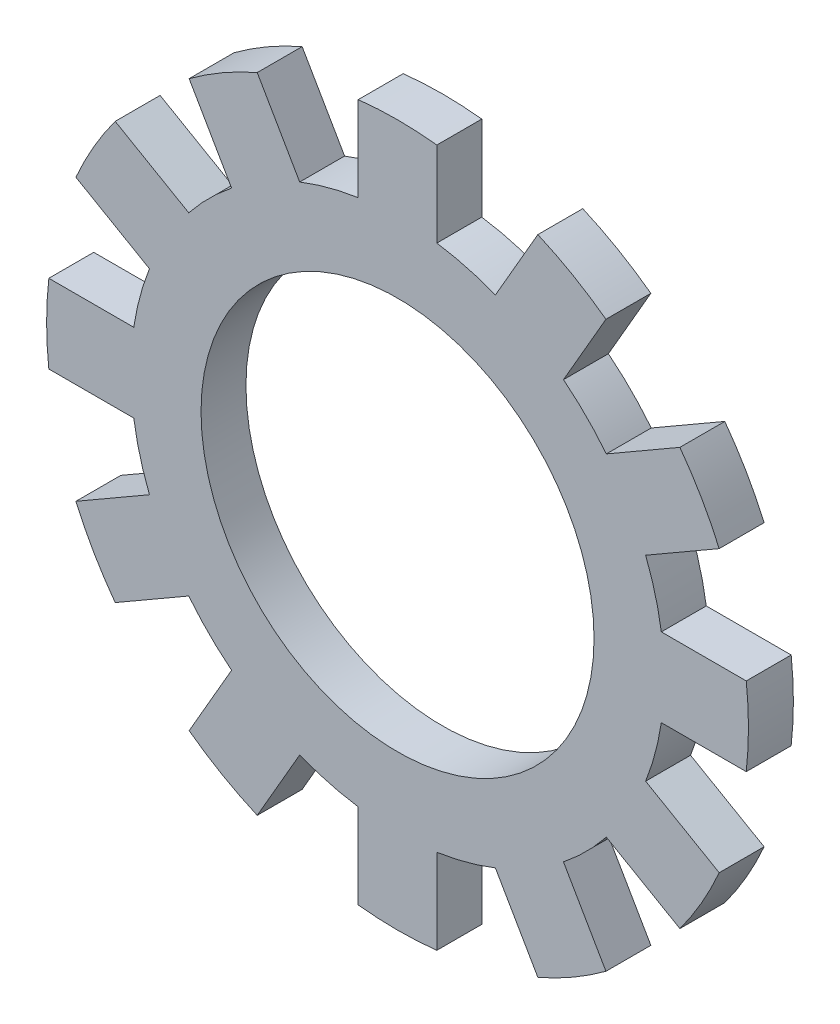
ISO-10303-21;
HEADER;
FILE_DESCRIPTION(('STEP AP214'),'2;1');
FILE_NAME('part.step','',(''),(''),'','','');
FILE_SCHEMA(('AUTOMOTIVE_DESIGN { 1 0 10303 214 1 1 1 1 }'));
ENDSEC;
DATA;
#1=APPLICATION_CONTEXT('core data for automotive mechanical design processes');
#2=APPLICATION_PROTOCOL_DEFINITION('international standard','automotive_design',2000,#1);
#3=PRODUCT_CONTEXT('',#1,'mechanical');
#4=PRODUCT('Part','Part','',(#3));
#5=PRODUCT_RELATED_PRODUCT_CATEGORY('part','',(#4));
#6=PRODUCT_DEFINITION_FORMATION('','',#4);
#7=PRODUCT_DEFINITION_CONTEXT('part definition',#1,'design');
#8=PRODUCT_DEFINITION('design','',#6,#7);
#9=PRODUCT_DEFINITION_SHAPE('','',#8);
#10=(LENGTH_UNIT() NAMED_UNIT(*) SI_UNIT(.MILLI.,.METRE.));
#11=(NAMED_UNIT(*) PLANE_ANGLE_UNIT() SI_UNIT($,.RADIAN.));
#12=(NAMED_UNIT(*) SI_UNIT($,.STERADIAN.) SOLID_ANGLE_UNIT());
#13=UNCERTAINTY_MEASURE_WITH_UNIT(LENGTH_MEASURE(1.E-05),#10,'distance_accuracy_value','');
#14=(GEOMETRIC_REPRESENTATION_CONTEXT(3) GLOBAL_UNCERTAINTY_ASSIGNED_CONTEXT((#13)) GLOBAL_UNIT_ASSIGNED_CONTEXT((#10,
#11,#12)) REPRESENTATION_CONTEXT('',''));
#15=CARTESIAN_POINT('',(0.,0.,0.));
#16=DIRECTION('',(0.,0.,1.));
#17=DIRECTION('',(1.,0.,0.));
#18=AXIS2_PLACEMENT_3D('',#15,#16,#17);
#19=CARTESIAN_POINT('',(0.,0.,0.4));
#20=DIRECTION('',(0.,0.,-1.));
#21=DIRECTION('',(-1.,0.,0.));
#22=AXIS2_PLACEMENT_3D('',#19,#20,#21);
#23=CYLINDRICAL_SURFACE('',#22,4.75);
#24=CARTESIAN_POINT('',(0.,0.,-0.4));
#25=DIRECTION('',(0.,0.,1.));
#26=DIRECTION('',(1.,0.,0.));
#27=AXIS2_PLACEMENT_3D('',#24,#25,#26);
#28=CIRCLE('',#27,4.75);
#29=CARTESIAN_POINT('',(3.71870679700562,2.95528674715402,-0.4));
#30=VERTEX_POINT('',#29);
#31=CARTESIAN_POINT('',(2.95528674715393,3.71870679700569,-0.4));
#32=VERTEX_POINT('',#31);
#33=EDGE_CURVE('E361',#30,#32,#28,.T.);
#34=ORIENTED_EDGE('',*,*,#33,.T.);
#35=DIRECTION('',(0.,0.,-1.));
#36=VECTOR('',#35,1.);
#37=CARTESIAN_POINT('',(2.95528674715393,3.71870679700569,0.4));
#38=LINE('',#37,#36);
#39=CARTESIAN_POINT('',(2.95528674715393,3.71870679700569,0.4));
#40=VERTEX_POINT('',#39);
#41=EDGE_CURVE('E352',#40,#32,#38,.T.);
#42=ORIENTED_EDGE('',*,*,#41,.F.);
#43=CARTESIAN_POINT('',(0.,0.,0.4));
#44=DIRECTION('',(0.,0.,1.));
#45=DIRECTION('',(1.,0.,0.));
#46=AXIS2_PLACEMENT_3D('',#43,#44,#45);
#47=CIRCLE('',#46,4.75);
#48=CARTESIAN_POINT('',(3.71870679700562,2.95528674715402,0.4));
#49=VERTEX_POINT('',#48);
#50=EDGE_CURVE('E64',#49,#40,#47,.T.);
#51=ORIENTED_EDGE('',*,*,#50,.F.);
#52=DIRECTION('',(0.,0.,-1.));
#53=VECTOR('',#52,1.);
#54=CARTESIAN_POINT('',(3.71870679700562,2.95528674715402,0.4));
#55=LINE('',#54,#53);
#56=EDGE_CURVE('E628',#49,#30,#55,.T.);
#57=ORIENTED_EDGE('',*,*,#56,.T.);
#58=EDGE_LOOP('',(#34,#42,#51,#57));
#59=FACE_BOUND('',#58,.T.);
#60=ADVANCED_FACE('F39',(#59),#23,.T.);
#61=DIRECTION('',(0.,0.,-1.));
#62=VECTOR('',#61,1.);
#63=CARTESIAN_POINT('',(1.74285118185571,4.41870679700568,0.4));
#64=LINE('',#63,#62);
#65=CARTESIAN_POINT('',(1.74285118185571,4.41870679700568,0.4));
#66=VERTEX_POINT('',#65);
#67=CARTESIAN_POINT('',(1.74285118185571,4.41870679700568,-0.4));
#68=VERTEX_POINT('',#67);
#69=EDGE_CURVE('E647',#66,#68,#64,.T.);
#70=ORIENTED_EDGE('',*,*,#69,.T.);
#71=CARTESIAN_POINT('',(0.7,4.69813792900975,-0.4));
#72=VERTEX_POINT('',#71);
#73=EDGE_CURVE('E388',#68,#72,#28,.T.);
#74=ORIENTED_EDGE('',*,*,#73,.T.);
#75=DIRECTION('',(0.,0.,-1.));
#76=VECTOR('',#75,1.);
#77=CARTESIAN_POINT('',(0.7,4.69813792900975,0.4));
#78=LINE('',#77,#76);
#79=CARTESIAN_POINT('',(0.7,4.69813792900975,0.4));
#80=VERTEX_POINT('',#79);
#81=EDGE_CURVE('E405',#80,#72,#78,.T.);
#82=ORIENTED_EDGE('',*,*,#81,.F.);
#83=EDGE_CURVE('E50',#66,#80,#47,.T.);
#84=ORIENTED_EDGE('',*,*,#83,.F.);
#85=EDGE_LOOP('',(#70,#74,#82,#84));
#86=FACE_BOUND('',#85,.T.);
#87=ADVANCED_FACE('F817',(#86),#23,.T.);
#88=CARTESIAN_POINT('',(4.69813792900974,0.700000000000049,-0.4));
#89=VERTEX_POINT('',#88);
#90=CARTESIAN_POINT('',(4.41870679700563,1.74285118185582,-0.4));
#91=VERTEX_POINT('',#90);
#92=EDGE_CURVE('E905',#89,#91,#28,.T.);
#93=ORIENTED_EDGE('',*,*,#92,.T.);
#94=DIRECTION('',(0.,0.,-1.));
#95=VECTOR('',#94,1.);
#96=CARTESIAN_POINT('',(4.41870679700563,1.74285118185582,0.4));
#97=LINE('',#96,#95);
#98=CARTESIAN_POINT('',(4.41870679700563,1.74285118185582,0.4));
#99=VERTEX_POINT('',#98);
#100=EDGE_CURVE('E787',#99,#91,#97,.T.);
#101=ORIENTED_EDGE('',*,*,#100,.F.);
#102=CARTESIAN_POINT('',(4.69813792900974,0.700000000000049,0.4));
#103=VERTEX_POINT('',#102);
#104=EDGE_CURVE('E371',#103,#99,#47,.T.);
#105=ORIENTED_EDGE('',*,*,#104,.F.);
#106=DIRECTION('',(0.,0.,-1.));
#107=VECTOR('',#106,1.);
#108=CARTESIAN_POINT('',(4.69813792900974,0.700000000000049,0.4));
#109=LINE('',#108,#107);
#110=EDGE_CURVE('E606',#103,#89,#109,.T.);
#111=ORIENTED_EDGE('',*,*,#110,.T.);
#112=EDGE_LOOP('',(#93,#101,#105,#111));
#113=FACE_BOUND('',#112,.T.);
#114=ADVANCED_FACE('F903',(#113),#23,.T.);
#115=CARTESIAN_POINT('',(4.41870679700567,-1.74285118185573,-0.4));
#116=VERTEX_POINT('',#115);
#117=CARTESIAN_POINT('',(4.69813792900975,-0.699999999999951,-0.4));
#118=VERTEX_POINT('',#117);
#119=EDGE_CURVE('E886',#116,#118,#28,.T.);
#120=ORIENTED_EDGE('',*,*,#119,.T.);
#121=DIRECTION('',(0.,0.,-1.));
#122=VECTOR('',#121,1.);
#123=CARTESIAN_POINT('',(4.69813792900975,-0.699999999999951,0.4));
#124=LINE('',#123,#122);
#125=CARTESIAN_POINT('',(4.69813792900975,-0.699999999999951,0.4));
#126=VERTEX_POINT('',#125);
#127=EDGE_CURVE('E773',#126,#118,#124,.T.);
#128=ORIENTED_EDGE('',*,*,#127,.F.);
#129=CARTESIAN_POINT('',(4.41870679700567,-1.74285118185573,0.4));
#130=VERTEX_POINT('',#129);
#131=EDGE_CURVE('E376',#130,#126,#47,.T.);
#132=ORIENTED_EDGE('',*,*,#131,.F.);
#133=DIRECTION('',(0.,0.,-1.));
#134=VECTOR('',#133,1.);
#135=CARTESIAN_POINT('',(4.41870679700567,-1.74285118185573,0.4));
#136=LINE('',#135,#134);
#137=EDGE_CURVE('E584',#130,#116,#136,.T.);
#138=ORIENTED_EDGE('',*,*,#137,.T.);
#139=EDGE_LOOP('',(#120,#128,#132,#138));
#140=FACE_BOUND('',#139,.T.);
#141=ADVANCED_FACE('F885',(#140),#23,.T.);
#142=CARTESIAN_POINT('',(2.95528674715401,-3.71870679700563,-0.4));
#143=VERTEX_POINT('',#142);
#144=CARTESIAN_POINT('',(3.71870679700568,-2.95528674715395,-0.4));
#145=VERTEX_POINT('',#144);
#146=EDGE_CURVE('E965',#143,#145,#28,.T.);
#147=ORIENTED_EDGE('',*,*,#146,.T.);
#148=DIRECTION('',(0.,0.,-1.));
#149=VECTOR('',#148,1.);
#150=CARTESIAN_POINT('',(3.71870679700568,-2.95528674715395,0.4));
#151=LINE('',#150,#149);
#152=CARTESIAN_POINT('',(3.71870679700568,-2.95528674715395,0.4));
#153=VERTEX_POINT('',#152);
#154=EDGE_CURVE('E759',#153,#145,#151,.T.);
#155=ORIENTED_EDGE('',*,*,#154,.F.);
#156=CARTESIAN_POINT('',(2.95528674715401,-3.71870679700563,0.4));
#157=VERTEX_POINT('',#156);
#158=EDGE_CURVE('E872',#157,#153,#47,.T.);
#159=ORIENTED_EDGE('',*,*,#158,.F.);
#160=DIRECTION('',(0.,0.,-1.));
#161=VECTOR('',#160,1.);
#162=CARTESIAN_POINT('',(2.95528674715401,-3.71870679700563,0.4));
#163=LINE('',#162,#161);
#164=EDGE_CURVE('E562',#157,#143,#163,.T.);
#165=ORIENTED_EDGE('',*,*,#164,.T.);
#166=EDGE_LOOP('',(#147,#155,#159,#165));
#167=FACE_BOUND('',#166,.T.);
#168=ADVANCED_FACE('F974',(#167),#23,.T.);
#169=CARTESIAN_POINT('',(0.7,-4.69813792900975,-0.4));
#170=VERTEX_POINT('',#169);
#171=CARTESIAN_POINT('',(1.7428511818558,-4.41870679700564,-0.4));
#172=VERTEX_POINT('',#171);
#173=EDGE_CURVE('E960',#170,#172,#28,.T.);
#174=ORIENTED_EDGE('',*,*,#173,.T.);
#175=DIRECTION('',(0.,0.,-1.));
#176=VECTOR('',#175,1.);
#177=CARTESIAN_POINT('',(1.7428511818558,-4.41870679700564,0.4));
#178=LINE('',#177,#176);
#179=CARTESIAN_POINT('',(1.7428511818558,-4.41870679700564,0.4));
#180=VERTEX_POINT('',#179);
#181=EDGE_CURVE('E745',#180,#172,#178,.T.);
#182=ORIENTED_EDGE('',*,*,#181,.F.);
#183=CARTESIAN_POINT('',(0.7,-4.69813792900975,0.4));
#184=VERTEX_POINT('',#183);
#185=EDGE_CURVE('E868',#184,#180,#47,.T.);
#186=ORIENTED_EDGE('',*,*,#185,.F.);
#187=DIRECTION('',(0.,0.,-1.));
#188=VECTOR('',#187,1.);
#189=CARTESIAN_POINT('',(0.7,-4.69813792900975,0.4));
#190=LINE('',#189,#188);
#191=EDGE_CURVE('E540',#184,#170,#190,.T.);
#192=ORIENTED_EDGE('',*,*,#191,.T.);
#193=EDGE_LOOP('',(#174,#182,#186,#192));
#194=FACE_BOUND('',#193,.T.);
#195=ADVANCED_FACE('F1402',(#194),#23,.T.);
#196=CARTESIAN_POINT('',(-1.74285118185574,-4.41870679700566,-0.4));
#197=VERTEX_POINT('',#196);
#198=CARTESIAN_POINT('',(-0.7,-4.69813792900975,-0.4));
#199=VERTEX_POINT('',#198);
#200=EDGE_CURVE('E955',#197,#199,#28,.T.);
#201=ORIENTED_EDGE('',*,*,#200,.T.);
#202=DIRECTION('',(0.,0.,-1.));
#203=VECTOR('',#202,1.);
#204=CARTESIAN_POINT('',(-0.7,-4.69813792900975,0.4));
#205=LINE('',#204,#203);
#206=CARTESIAN_POINT('',(-0.7,-4.69813792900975,0.4));
#207=VERTEX_POINT('',#206);
#208=EDGE_CURVE('E731',#207,#199,#205,.T.);
#209=ORIENTED_EDGE('',*,*,#208,.F.);
#210=CARTESIAN_POINT('',(-1.74285118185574,-4.41870679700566,0.4));
#211=VERTEX_POINT('',#210);
#212=EDGE_CURVE('E864',#211,#207,#47,.T.);
#213=ORIENTED_EDGE('',*,*,#212,.F.);
#214=DIRECTION('',(0.,0.,-1.));
#215=VECTOR('',#214,1.);
#216=CARTESIAN_POINT('',(-1.74285118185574,-4.41870679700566,0.4));
#217=LINE('',#216,#215);
#218=EDGE_CURVE('E518',#211,#197,#217,.T.);
#219=ORIENTED_EDGE('',*,*,#218,.T.);
#220=EDGE_LOOP('',(#201,#209,#213,#219));
#221=FACE_BOUND('',#220,.T.);
#222=ADVANCED_FACE('F1394',(#221),#23,.T.);
#223=CARTESIAN_POINT('',(-3.71870679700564,-2.955286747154,-0.4));
#224=VERTEX_POINT('',#223);
#225=CARTESIAN_POINT('',(-2.95528674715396,-3.71870679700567,-0.4));
#226=VERTEX_POINT('',#225);
#227=EDGE_CURVE('E950',#224,#226,#28,.T.);
#228=ORIENTED_EDGE('',*,*,#227,.T.);
#229=DIRECTION('',(0.,0.,-1.));
#230=VECTOR('',#229,1.);
#231=CARTESIAN_POINT('',(-2.95528674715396,-3.71870679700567,0.4));
#232=LINE('',#231,#230);
#233=CARTESIAN_POINT('',(-2.95528674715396,-3.71870679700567,0.4));
#234=VERTEX_POINT('',#233);
#235=EDGE_CURVE('E717',#234,#226,#232,.T.);
#236=ORIENTED_EDGE('',*,*,#235,.F.);
#237=CARTESIAN_POINT('',(-3.71870679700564,-2.955286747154,0.4));
#238=VERTEX_POINT('',#237);
#239=EDGE_CURVE('E860',#238,#234,#47,.T.);
#240=ORIENTED_EDGE('',*,*,#239,.F.);
#241=DIRECTION('',(0.,0.,-1.));
#242=VECTOR('',#241,1.);
#243=CARTESIAN_POINT('',(-3.71870679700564,-2.955286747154,0.4));
#244=LINE('',#243,#242);
#245=EDGE_CURVE('E496',#238,#224,#244,.T.);
#246=ORIENTED_EDGE('',*,*,#245,.T.);
#247=EDGE_LOOP('',(#228,#236,#240,#246));
#248=FACE_BOUND('',#247,.T.);
#249=ADVANCED_FACE('F1386',(#248),#23,.T.);
#250=CARTESIAN_POINT('',(-4.69813792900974,-0.700000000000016,-0.4));
#251=VERTEX_POINT('',#250);
#252=CARTESIAN_POINT('',(-4.41870679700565,-1.74285118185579,-0.4));
#253=VERTEX_POINT('',#252);
#254=EDGE_CURVE('E946',#251,#253,#28,.T.);
#255=ORIENTED_EDGE('',*,*,#254,.T.);
#256=DIRECTION('',(0.,0.,-1.));
#257=VECTOR('',#256,1.);
#258=CARTESIAN_POINT('',(-4.41870679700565,-1.74285118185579,0.4));
#259=LINE('',#258,#257);
#260=CARTESIAN_POINT('',(-4.41870679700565,-1.74285118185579,0.4));
#261=VERTEX_POINT('',#260);
#262=EDGE_CURVE('E703',#261,#253,#259,.T.);
#263=ORIENTED_EDGE('',*,*,#262,.F.);
#264=CARTESIAN_POINT('',(-4.69813792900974,-0.700000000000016,0.4));
#265=VERTEX_POINT('',#264);
#266=EDGE_CURVE('E856',#265,#261,#47,.T.);
#267=ORIENTED_EDGE('',*,*,#266,.F.);
#268=DIRECTION('',(0.,0.,-1.));
#269=VECTOR('',#268,1.);
#270=CARTESIAN_POINT('',(-4.69813792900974,-0.700000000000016,0.4));
#271=LINE('',#270,#269);
#272=EDGE_CURVE('E474',#265,#251,#271,.T.);
#273=ORIENTED_EDGE('',*,*,#272,.T.);
#274=EDGE_LOOP('',(#255,#263,#267,#273));
#275=FACE_BOUND('',#274,.T.);
#276=ADVANCED_FACE('F938',(#275),#23,.T.);
#277=CARTESIAN_POINT('',(-4.41870679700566,1.74285118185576,-0.4));
#278=VERTEX_POINT('',#277);
#279=CARTESIAN_POINT('',(-4.69813792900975,0.699999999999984,-0.4));
#280=VERTEX_POINT('',#279);
#281=EDGE_CURVE('E943',#278,#280,#28,.T.);
#282=ORIENTED_EDGE('',*,*,#281,.T.);
#283=DIRECTION('',(0.,0.,-1.));
#284=VECTOR('',#283,1.);
#285=CARTESIAN_POINT('',(-4.69813792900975,0.699999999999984,0.4));
#286=LINE('',#285,#284);
#287=CARTESIAN_POINT('',(-4.69813792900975,0.699999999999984,0.4));
#288=VERTEX_POINT('',#287);
#289=EDGE_CURVE('E689',#288,#280,#286,.T.);
#290=ORIENTED_EDGE('',*,*,#289,.F.);
#291=CARTESIAN_POINT('',(-4.41870679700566,1.74285118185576,0.4));
#292=VERTEX_POINT('',#291);
#293=EDGE_CURVE('E852',#292,#288,#47,.T.);
#294=ORIENTED_EDGE('',*,*,#293,.F.);
#295=DIRECTION('',(0.,0.,-1.));
#296=VECTOR('',#295,1.);
#297=CARTESIAN_POINT('',(-4.41870679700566,1.74285118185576,0.4));
#298=LINE('',#297,#296);
#299=EDGE_CURVE('E452',#292,#278,#298,.T.);
#300=ORIENTED_EDGE('',*,*,#299,.T.);
#301=EDGE_LOOP('',(#282,#290,#294,#300));
#302=FACE_BOUND('',#301,.T.);
#303=ADVANCED_FACE('F934',(#302),#23,.T.);
#304=CARTESIAN_POINT('',(-2.95528674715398,3.71870679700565,-0.4));
#305=VERTEX_POINT('',#304);
#306=CARTESIAN_POINT('',(-3.71870679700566,2.95528674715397,-0.4));
#307=VERTEX_POINT('',#306);
#308=EDGE_CURVE('E941',#305,#307,#28,.T.);
#309=ORIENTED_EDGE('',*,*,#308,.T.);
#310=DIRECTION('',(0.,0.,-1.));
#311=VECTOR('',#310,1.);
#312=CARTESIAN_POINT('',(-3.71870679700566,2.95528674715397,0.4));
#313=LINE('',#312,#311);
#314=CARTESIAN_POINT('',(-3.71870679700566,2.95528674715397,0.4));
#315=VERTEX_POINT('',#314);
#316=EDGE_CURVE('E675',#315,#307,#313,.T.);
#317=ORIENTED_EDGE('',*,*,#316,.F.);
#318=CARTESIAN_POINT('',(-2.95528674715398,3.71870679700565,0.4));
#319=VERTEX_POINT('',#318);
#320=EDGE_CURVE('E49',#319,#315,#47,.T.);
#321=ORIENTED_EDGE('',*,*,#320,.F.);
#322=DIRECTION('',(0.,0.,-1.));
#323=VECTOR('',#322,1.);
#324=CARTESIAN_POINT('',(-2.95528674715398,3.71870679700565,0.4));
#325=LINE('',#324,#323);
#326=EDGE_CURVE('E430',#319,#305,#325,.T.);
#327=ORIENTED_EDGE('',*,*,#326,.T.);
#328=EDGE_LOOP('',(#309,#317,#321,#327));
#329=FACE_BOUND('',#328,.T.);
#330=ADVANCED_FACE('F928',(#329),#23,.T.);
#331=CARTESIAN_POINT('',(-0.7,4.69813792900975,-0.4));
#332=VERTEX_POINT('',#331);
#333=CARTESIAN_POINT('',(-1.74285118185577,4.41870679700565,-0.4));
#334=VERTEX_POINT('',#333);
#335=EDGE_CURVE('E43',#332,#334,#28,.T.);
#336=ORIENTED_EDGE('',*,*,#335,.T.);
#337=DIRECTION('',(0.,0.,-1.));
#338=VECTOR('',#337,1.);
#339=CARTESIAN_POINT('',(-1.74285118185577,4.41870679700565,0.4));
#340=LINE('',#339,#338);
#341=CARTESIAN_POINT('',(-1.74285118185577,4.41870679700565,0.4));
#342=VERTEX_POINT('',#341);
#343=EDGE_CURVE('E659',#342,#334,#340,.T.);
#344=ORIENTED_EDGE('',*,*,#343,.F.);
#345=CARTESIAN_POINT('',(-0.7,4.69813792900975,0.4));
#346=VERTEX_POINT('',#345);
#347=EDGE_CURVE('E11',#346,#342,#47,.T.);
#348=ORIENTED_EDGE('',*,*,#347,.F.);
#349=DIRECTION('',(0.,0.,-1.));
#350=VECTOR('',#349,1.);
#351=CARTESIAN_POINT('',(-0.7,4.69813792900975,0.4));
#352=LINE('',#351,#350);
#353=EDGE_CURVE('E392',#346,#332,#352,.T.);
#354=ORIENTED_EDGE('',*,*,#353,.T.);
#355=EDGE_LOOP('',(#336,#344,#348,#354));
#356=FACE_BOUND('',#355,.T.);
#357=ADVANCED_FACE('F41',(#356),#23,.T.);
#358=CARTESIAN_POINT('',(0.,0.,0.4));
#359=DIRECTION('',(0.,0.,1.));
#360=DIRECTION('',(1.,0.,0.));
#361=AXIS2_PLACEMENT_3D('',#358,#359,#360);
#362=PLANE('',#361);
#363=ORIENTED_EDGE('',*,*,#347,.T.);
#364=DIRECTION('',(0.500000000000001,-0.866025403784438,0.));
#365=VECTOR('',#364,1.);
#366=CARTESIAN_POINT('',(-2.49912036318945,5.7286034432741,0.4));
#367=LINE('',#366,#365);
#368=CARTESIAN_POINT('',(-2.49912036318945,5.7286034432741,0.4));
#369=VERTEX_POINT('',#368);
#370=EDGE_CURVE('E670',#369,#342,#367,.T.);
#371=ORIENTED_EDGE('',*,*,#370,.F.);
#372=CARTESIAN_POINT('',(0.,0.,0.4));
#373=DIRECTION('',(0.,0.,1.));
#374=DIRECTION('',(0.866025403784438,0.500000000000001,0.));
#375=AXIS2_PLACEMENT_3D('',#372,#373,#374);
#376=CIRCLE('',#375,6.25);
#377=CARTESIAN_POINT('',(-3.71155592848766,5.0286034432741,0.4));
#378=VERTEX_POINT('',#377);
#379=EDGE_CURVE('E439',#369,#378,#376,.T.);
#380=ORIENTED_EDGE('',*,*,#379,.T.);
#381=DIRECTION('',(0.500000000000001,-0.866025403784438,0.));
#382=VECTOR('',#381,1.);
#383=CARTESIAN_POINT('',(-3.71155592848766,5.0286034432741,0.4));
#384=LINE('',#383,#382);
#385=EDGE_CURVE('E434',#378,#319,#384,.T.);
#386=ORIENTED_EDGE('',*,*,#385,.T.);
#387=ORIENTED_EDGE('',*,*,#320,.T.);
#388=DIRECTION('',(0.86602540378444,-0.499999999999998,0.));
#389=VECTOR('',#388,1.);
#390=CARTESIAN_POINT('',(-5.02860344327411,3.71155592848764,0.4));
#391=LINE('',#390,#389);
#392=CARTESIAN_POINT('',(-5.02860344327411,3.71155592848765,0.4));
#393=VERTEX_POINT('',#392);
#394=EDGE_CURVE('E684',#393,#315,#391,.T.);
#395=ORIENTED_EDGE('',*,*,#394,.F.);
#396=CARTESIAN_POINT('',(0.,0.,0.4));
#397=DIRECTION('',(0.,0.,1.));
#398=DIRECTION('',(0.499999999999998,0.86602540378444,0.));
#399=AXIS2_PLACEMENT_3D('',#396,#397,#398);
#400=CIRCLE('',#399,6.25);
#401=CARTESIAN_POINT('',(-5.72860344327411,2.49912036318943,0.4));
#402=VERTEX_POINT('',#401);
#403=EDGE_CURVE('E461',#393,#402,#400,.T.);
#404=ORIENTED_EDGE('',*,*,#403,.T.);
#405=DIRECTION('',(0.86602540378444,-0.499999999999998,0.));
#406=VECTOR('',#405,1.);
#407=CARTESIAN_POINT('',(-5.72860344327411,2.49912036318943,0.4));
#408=LINE('',#407,#406);
#409=EDGE_CURVE('E456',#402,#292,#408,.T.);
#410=ORIENTED_EDGE('',*,*,#409,.T.);
#411=ORIENTED_EDGE('',*,*,#293,.T.);
#412=DIRECTION('',(1.,0.,0.));
#413=VECTOR('',#412,1.);
#414=CARTESIAN_POINT('',(-6.2106762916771,0.699999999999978,0.4));
#415=LINE('',#414,#413);
#416=CARTESIAN_POINT('',(-6.2106762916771,0.699999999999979,0.4));
#417=VERTEX_POINT('',#416);
#418=EDGE_CURVE('E698',#417,#288,#415,.T.);
#419=ORIENTED_EDGE('',*,*,#418,.F.);
#420=CARTESIAN_POINT('',(0.,0.,0.4));
#421=DIRECTION('',(0.,0.,1.));
#422=DIRECTION('',(0.,1.,0.));
#423=AXIS2_PLACEMENT_3D('',#420,#421,#422);
#424=CIRCLE('',#423,6.25);
#425=CARTESIAN_POINT('',(-6.2106762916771,-0.700000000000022,0.4));
#426=VERTEX_POINT('',#425);
#427=EDGE_CURVE('E483',#417,#426,#424,.T.);
#428=ORIENTED_EDGE('',*,*,#427,.T.);
#429=DIRECTION('',(1.,0.,0.));
#430=VECTOR('',#429,1.);
#431=CARTESIAN_POINT('',(-6.2106762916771,-0.700000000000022,0.4));
#432=LINE('',#431,#430);
#433=EDGE_CURVE('E478',#426,#265,#432,.T.);
#434=ORIENTED_EDGE('',*,*,#433,.T.);
#435=ORIENTED_EDGE('',*,*,#266,.T.);
#436=DIRECTION('',(0.866025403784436,0.500000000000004,0.));
#437=VECTOR('',#436,1.);
#438=CARTESIAN_POINT('',(-5.72860344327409,-2.49912036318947,0.4));
#439=LINE('',#438,#437);
#440=CARTESIAN_POINT('',(-5.72860344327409,-2.49912036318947,0.4));
#441=VERTEX_POINT('',#440);
#442=EDGE_CURVE('E712',#441,#261,#439,.T.);
#443=ORIENTED_EDGE('',*,*,#442,.F.);
#444=CARTESIAN_POINT('',(0.,0.,0.4));
#445=DIRECTION('',(0.,0.,1.));
#446=DIRECTION('',(-0.500000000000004,0.866025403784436,0.));
#447=AXIS2_PLACEMENT_3D('',#444,#445,#446);
#448=CIRCLE('',#447,6.25);
#449=CARTESIAN_POINT('',(-5.02860344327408,-3.71155592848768,0.4));
#450=VERTEX_POINT('',#449);
#451=EDGE_CURVE('E505',#441,#450,#448,.T.);
#452=ORIENTED_EDGE('',*,*,#451,.T.);
#453=DIRECTION('',(0.866025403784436,0.500000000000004,0.));
#454=VECTOR('',#453,1.);
#455=CARTESIAN_POINT('',(-5.02860344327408,-3.71155592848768,0.4));
#456=LINE('',#455,#454);
#457=EDGE_CURVE('E500',#450,#238,#456,.T.);
#458=ORIENTED_EDGE('',*,*,#457,.T.);
#459=ORIENTED_EDGE('',*,*,#239,.T.);
#460=DIRECTION('',(0.499999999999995,0.866025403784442,0.));
#461=VECTOR('',#460,1.);
#462=CARTESIAN_POINT('',(-3.71155592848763,-5.02860344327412,0.4));
#463=LINE('',#462,#461);
#464=CARTESIAN_POINT('',(-3.71155592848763,-5.02860344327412,0.4));
#465=VERTEX_POINT('',#464);
#466=EDGE_CURVE('E726',#465,#234,#463,.T.);
#467=ORIENTED_EDGE('',*,*,#466,.F.);
#468=CARTESIAN_POINT('',(0.,0.,0.4));
#469=DIRECTION('',(0.,0.,1.));
#470=DIRECTION('',(-0.866025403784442,0.499999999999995,0.));
#471=AXIS2_PLACEMENT_3D('',#468,#469,#470);
#472=CIRCLE('',#471,6.25);
#473=CARTESIAN_POINT('',(-2.49912036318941,-5.72860344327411,0.4));
#474=VERTEX_POINT('',#473);
#475=EDGE_CURVE('E527',#465,#474,#472,.T.);
#476=ORIENTED_EDGE('',*,*,#475,.T.);
#477=DIRECTION('',(0.499999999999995,0.866025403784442,0.));
#478=VECTOR('',#477,1.);
#479=CARTESIAN_POINT('',(-2.49912036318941,-5.72860344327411,0.4));
#480=LINE('',#479,#478);
#481=EDGE_CURVE('E522',#474,#211,#480,.T.);
#482=ORIENTED_EDGE('',*,*,#481,.T.);
#483=ORIENTED_EDGE('',*,*,#212,.T.);
#484=DIRECTION('',(0.,1.,0.));
#485=VECTOR('',#484,1.);
#486=CARTESIAN_POINT('',(-0.7,-6.2106762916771,0.4));
#487=LINE('',#486,#485);
#488=CARTESIAN_POINT('',(-0.700000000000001,-6.2106762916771,0.4));
#489=VERTEX_POINT('',#488);
#490=EDGE_CURVE('E740',#489,#207,#487,.T.);
#491=ORIENTED_EDGE('',*,*,#490,.F.);
#492=CARTESIAN_POINT('',(0.,0.,0.4));
#493=DIRECTION('',(0.,0.,1.));
#494=DIRECTION('',(-1.,0.,0.));
#495=AXIS2_PLACEMENT_3D('',#492,#493,#494);
#496=CIRCLE('',#495,6.25);
#497=CARTESIAN_POINT('',(0.700000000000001,-6.2106762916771,0.4));
#498=VERTEX_POINT('',#497);
#499=EDGE_CURVE('E549',#489,#498,#496,.T.);
#500=ORIENTED_EDGE('',*,*,#499,.T.);
#501=DIRECTION('',(0.,1.,0.));
#502=VECTOR('',#501,1.);
#503=CARTESIAN_POINT('',(0.7,-6.2106762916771,0.4));
#504=LINE('',#503,#502);
#505=EDGE_CURVE('E544',#498,#184,#504,.T.);
#506=ORIENTED_EDGE('',*,*,#505,.T.);
#507=ORIENTED_EDGE('',*,*,#185,.T.);
#508=DIRECTION('',(-0.500000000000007,0.866025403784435,0.));
#509=VECTOR('',#508,1.);
#510=CARTESIAN_POINT('',(2.49912036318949,-5.72860344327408,0.4));
#511=LINE('',#510,#509);
#512=CARTESIAN_POINT('',(2.49912036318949,-5.72860344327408,0.4));
#513=VERTEX_POINT('',#512);
#514=EDGE_CURVE('E754',#513,#180,#511,.T.);
#515=ORIENTED_EDGE('',*,*,#514,.F.);
#516=CARTESIAN_POINT('',(0.,0.,0.4));
#517=DIRECTION('',(0.,0.,1.));
#518=DIRECTION('',(-0.866025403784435,-0.500000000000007,0.));
#519=AXIS2_PLACEMENT_3D('',#516,#517,#518);
#520=CIRCLE('',#519,6.25);
#521=CARTESIAN_POINT('',(3.7115559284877,-5.02860344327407,0.4));
#522=VERTEX_POINT('',#521);
#523=EDGE_CURVE('E571',#513,#522,#520,.T.);
#524=ORIENTED_EDGE('',*,*,#523,.T.);
#525=DIRECTION('',(-0.500000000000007,0.866025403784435,0.));
#526=VECTOR('',#525,1.);
#527=CARTESIAN_POINT('',(3.7115559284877,-5.02860344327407,0.4));
#528=LINE('',#527,#526);
#529=EDGE_CURVE('E566',#522,#157,#528,.T.);
#530=ORIENTED_EDGE('',*,*,#529,.T.);
#531=ORIENTED_EDGE('',*,*,#158,.T.);
#532=DIRECTION('',(-0.866025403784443,0.499999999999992,0.));
#533=VECTOR('',#532,1.);
#534=CARTESIAN_POINT('',(5.02860344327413,-3.71155592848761,0.4));
#535=LINE('',#534,#533);
#536=CARTESIAN_POINT('',(5.02860344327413,-3.71155592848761,0.4));
#537=VERTEX_POINT('',#536);
#538=EDGE_CURVE('E768',#537,#153,#535,.T.);
#539=ORIENTED_EDGE('',*,*,#538,.F.);
#540=CARTESIAN_POINT('',(0.,0.,0.4));
#541=DIRECTION('',(0.,0.,1.));
#542=DIRECTION('',(-0.499999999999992,-0.866025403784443,0.));
#543=AXIS2_PLACEMENT_3D('',#540,#541,#542);
#544=CIRCLE('',#543,6.25);
#545=CARTESIAN_POINT('',(5.72860344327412,-2.49912036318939,0.4));
#546=VERTEX_POINT('',#545);
#547=EDGE_CURVE('E593',#537,#546,#544,.T.);
#548=ORIENTED_EDGE('',*,*,#547,.T.);
#549=DIRECTION('',(-0.866025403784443,0.499999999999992,0.));
#550=VECTOR('',#549,1.);
#551=CARTESIAN_POINT('',(5.72860344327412,-2.49912036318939,0.4));
#552=LINE('',#551,#550);
#553=EDGE_CURVE('E588',#546,#130,#552,.T.);
#554=ORIENTED_EDGE('',*,*,#553,.T.);
#555=ORIENTED_EDGE('',*,*,#131,.T.);
#556=DIRECTION('',(-1.,0.,0.));
#557=VECTOR('',#556,1.);
#558=CARTESIAN_POINT('',(6.21067629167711,-0.699999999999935,0.4));
#559=LINE('',#558,#557);
#560=CARTESIAN_POINT('',(6.21067629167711,-0.699999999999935,0.4));
#561=VERTEX_POINT('',#560);
#562=EDGE_CURVE('E782',#561,#126,#559,.T.);
#563=ORIENTED_EDGE('',*,*,#562,.F.);
#564=CARTESIAN_POINT('',(0.,0.,0.4));
#565=DIRECTION('',(0.,0.,1.));
#566=DIRECTION('',(0.,-1.,0.));
#567=AXIS2_PLACEMENT_3D('',#564,#565,#566);
#568=CIRCLE('',#567,6.25);
#569=CARTESIAN_POINT('',(6.21067629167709,0.700000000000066,0.4));
#570=VERTEX_POINT('',#569);
#571=EDGE_CURVE('E615',#561,#570,#568,.T.);
#572=ORIENTED_EDGE('',*,*,#571,.T.);
#573=DIRECTION('',(-1.,0.,0.));
#574=VECTOR('',#573,1.);
#575=CARTESIAN_POINT('',(6.21067629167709,0.700000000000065,0.4));
#576=LINE('',#575,#574);
#577=EDGE_CURVE('E610',#570,#103,#576,.T.);
#578=ORIENTED_EDGE('',*,*,#577,.T.);
#579=ORIENTED_EDGE('',*,*,#104,.T.);
#580=DIRECTION('',(-0.866025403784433,-0.50000000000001,0.));
#581=VECTOR('',#580,1.);
#582=CARTESIAN_POINT('',(5.72860344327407,2.49912036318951,0.4));
#583=LINE('',#582,#581);
#584=CARTESIAN_POINT('',(5.72860344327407,2.49912036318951,0.4));
#585=VERTEX_POINT('',#584);
#586=EDGE_CURVE('E796',#585,#99,#583,.T.);
#587=ORIENTED_EDGE('',*,*,#586,.F.);
#588=CARTESIAN_POINT('',(0.,0.,0.4));
#589=DIRECTION('',(0.,0.,1.));
#590=DIRECTION('',(0.50000000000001,-0.866025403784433,0.));
#591=AXIS2_PLACEMENT_3D('',#588,#589,#590);
#592=CIRCLE('',#591,6.25);
#593=CARTESIAN_POINT('',(5.02860344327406,3.71155592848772,0.4));
#594=VERTEX_POINT('',#593);
#595=EDGE_CURVE('E635',#585,#594,#592,.T.);
#596=ORIENTED_EDGE('',*,*,#595,.T.);
#597=DIRECTION('',(-0.866025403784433,-0.50000000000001,0.));
#598=VECTOR('',#597,1.);
#599=CARTESIAN_POINT('',(5.02860344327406,3.71155592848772,0.4));
#600=LINE('',#599,#598);
#601=EDGE_CURVE('E368',#594,#49,#600,.T.);
#602=ORIENTED_EDGE('',*,*,#601,.T.);
#603=ORIENTED_EDGE('',*,*,#50,.T.);
#604=DIRECTION('',(-0.499999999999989,-0.866025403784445,0.));
#605=VECTOR('',#604,1.);
#606=CARTESIAN_POINT('',(3.71155592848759,5.02860344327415,0.4));
#607=LINE('',#606,#605);
#608=CARTESIAN_POINT('',(3.71155592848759,5.02860344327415,0.4));
#609=VERTEX_POINT('',#608);
#610=EDGE_CURVE('E349',#609,#40,#607,.T.);
#611=ORIENTED_EDGE('',*,*,#610,.F.);
#612=CARTESIAN_POINT('',(0.,0.,0.4));
#613=DIRECTION('',(0.,0.,1.));
#614=DIRECTION('',(0.866025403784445,-0.499999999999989,0.));
#615=AXIS2_PLACEMENT_3D('',#612,#613,#614);
#616=CIRCLE('',#615,6.25);
#617=CARTESIAN_POINT('',(2.49912036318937,5.72860344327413,0.4));
#618=VERTEX_POINT('',#617);
#619=EDGE_CURVE('E655',#609,#618,#616,.T.);
#620=ORIENTED_EDGE('',*,*,#619,.T.);
#621=DIRECTION('',(-0.499999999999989,-0.866025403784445,0.));
#622=VECTOR('',#621,1.);
#623=CARTESIAN_POINT('',(2.49912036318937,5.72860344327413,0.4));
#624=LINE('',#623,#622);
#625=EDGE_CURVE('E650',#618,#66,#624,.T.);
#626=ORIENTED_EDGE('',*,*,#625,.T.);
#627=ORIENTED_EDGE('',*,*,#83,.T.);
#628=DIRECTION('',(0.,-1.,0.));
#629=VECTOR('',#628,1.);
#630=CARTESIAN_POINT('',(0.7,6.2106762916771,0.4));
#631=LINE('',#630,#629);
#632=CARTESIAN_POINT('',(0.700000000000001,6.2106762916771,0.4));
#633=VERTEX_POINT('',#632);
#634=EDGE_CURVE('E418',#633,#80,#631,.T.);
#635=ORIENTED_EDGE('',*,*,#634,.F.);
#636=CARTESIAN_POINT('',(0.,0.,0.4));
#637=DIRECTION('',(0.,0.,1.));
#638=DIRECTION('',(1.,0.,0.));
#639=AXIS2_PLACEMENT_3D('',#636,#637,#638);
#640=CIRCLE('',#639,6.25);
#641=CARTESIAN_POINT('',(-0.700000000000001,6.2106762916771,0.4));
#642=VERTEX_POINT('',#641);
#643=EDGE_CURVE('E401',#633,#642,#640,.T.);
#644=ORIENTED_EDGE('',*,*,#643,.T.);
#645=DIRECTION('',(0.,-1.,0.));
#646=VECTOR('',#645,1.);
#647=CARTESIAN_POINT('',(-0.7,6.2106762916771,0.4));
#648=LINE('',#647,#646);
#649=EDGE_CURVE('E396',#642,#346,#648,.T.);
#650=ORIENTED_EDGE('',*,*,#649,.T.);
#651=EDGE_LOOP('',(#363,#371,#380,#386,#387,#395,#404,#410,#411,#419,#428,#434,#435,#443,#452,
#458,#459,#467,#476,#482,#483,#491,#500,#506,#507,#515,#524,#530,#531,#539,#548,#554,#555,#563,
#572,#578,#579,#587,#596,#602,#603,#611,#620,#626,#627,#635,#644,#650));
#652=FACE_BOUND('',#651,.T.);
#653=CARTESIAN_POINT('',(0.,0.,0.4));
#654=DIRECTION('',(0.,0.,1.));
#655=DIRECTION('',(1.,0.,0.));
#656=AXIS2_PLACEMENT_3D('',#653,#654,#655);
#657=CIRCLE('',#656,3.5);
#658=CARTESIAN_POINT('',(3.5,0.,0.4));
#659=VERTEX_POINT('',#658);
#660=EDGE_CURVE('E383',#659,#659,#657,.T.);
#661=ORIENTED_EDGE('',*,*,#660,.F.);
#662=EDGE_LOOP('',(#661));
#663=FACE_BOUND('',#662,.T.);
#664=ADVANCED_FACE('F365',(#652,#663),#362,.T.);
#665=CARTESIAN_POINT('',(0.,0.,-0.4));
#666=DIRECTION('',(0.,0.,1.));
#667=DIRECTION('',(1.,0.,0.));
#668=AXIS2_PLACEMENT_3D('',#665,#666,#667);
#669=PLANE('',#668);
#670=ORIENTED_EDGE('',*,*,#335,.F.);
#671=DIRECTION('',(0.,-1.,0.));
#672=VECTOR('',#671,1.);
#673=CARTESIAN_POINT('',(-0.7,6.2106762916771,-0.4));
#674=LINE('',#673,#672);
#675=CARTESIAN_POINT('',(-0.700000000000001,6.2106762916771,-0.4));
#676=VERTEX_POINT('',#675);
#677=EDGE_CURVE('E397',#676,#332,#674,.T.);
#678=ORIENTED_EDGE('',*,*,#677,.F.);
#679=CARTESIAN_POINT('',(0.,0.,-0.4));
#680=DIRECTION('',(0.,0.,1.));
#681=DIRECTION('',(1.,0.,0.));
#682=AXIS2_PLACEMENT_3D('',#679,#680,#681);
#683=CIRCLE('',#682,6.25);
#684=CARTESIAN_POINT('',(0.700000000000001,6.2106762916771,-0.4));
#685=VERTEX_POINT('',#684);
#686=EDGE_CURVE('E402',#685,#676,#683,.T.);
#687=ORIENTED_EDGE('',*,*,#686,.F.);
#688=DIRECTION('',(0.,-1.,0.));
#689=VECTOR('',#688,1.);
#690=CARTESIAN_POINT('',(0.7,6.2106762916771,-0.4));
#691=LINE('',#690,#689);
#692=EDGE_CURVE('E419',#685,#72,#691,.T.);
#693=ORIENTED_EDGE('',*,*,#692,.T.);
#694=ORIENTED_EDGE('',*,*,#73,.F.);
#695=DIRECTION('',(-0.499999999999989,-0.866025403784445,0.));
#696=VECTOR('',#695,1.);
#697=CARTESIAN_POINT('',(2.49912036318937,5.72860344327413,-0.4));
#698=LINE('',#697,#696);
#699=CARTESIAN_POINT('',(2.49912036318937,5.72860344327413,-0.4));
#700=VERTEX_POINT('',#699);
#701=EDGE_CURVE('E651',#700,#68,#698,.T.);
#702=ORIENTED_EDGE('',*,*,#701,.F.);
#703=CARTESIAN_POINT('',(0.,0.,-0.4));
#704=DIRECTION('',(0.,0.,1.));
#705=DIRECTION('',(0.866025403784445,-0.499999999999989,0.));
#706=AXIS2_PLACEMENT_3D('',#703,#704,#705);
#707=CIRCLE('',#706,6.25);
#708=CARTESIAN_POINT('',(3.71155592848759,5.02860344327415,-0.4));
#709=VERTEX_POINT('',#708);
#710=EDGE_CURVE('E656',#709,#700,#707,.T.);
#711=ORIENTED_EDGE('',*,*,#710,.F.);
#712=DIRECTION('',(-0.499999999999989,-0.866025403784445,0.));
#713=VECTOR('',#712,1.);
#714=CARTESIAN_POINT('',(3.71155592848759,5.02860344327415,-0.4));
#715=LINE('',#714,#713);
#716=EDGE_CURVE('E358',#709,#32,#715,.T.);
#717=ORIENTED_EDGE('',*,*,#716,.T.);
#718=ORIENTED_EDGE('',*,*,#33,.F.);
#719=DIRECTION('',(-0.866025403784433,-0.50000000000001,0.));
#720=VECTOR('',#719,1.);
#721=CARTESIAN_POINT('',(5.02860344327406,3.71155592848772,-0.4));
#722=LINE('',#721,#720);
#723=CARTESIAN_POINT('',(5.02860344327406,3.71155592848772,-0.4));
#724=VERTEX_POINT('',#723);
#725=EDGE_CURVE('E631',#724,#30,#722,.T.);
#726=ORIENTED_EDGE('',*,*,#725,.F.);
#727=CARTESIAN_POINT('',(0.,0.,-0.4));
#728=DIRECTION('',(0.,0.,1.));
#729=DIRECTION('',(0.50000000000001,-0.866025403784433,0.));
#730=AXIS2_PLACEMENT_3D('',#727,#728,#729);
#731=CIRCLE('',#730,6.25);
#732=CARTESIAN_POINT('',(5.72860344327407,2.49912036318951,-0.4));
#733=VERTEX_POINT('',#732);
#734=EDGE_CURVE('E636',#733,#724,#731,.T.);
#735=ORIENTED_EDGE('',*,*,#734,.F.);
#736=DIRECTION('',(-0.866025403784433,-0.50000000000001,0.));
#737=VECTOR('',#736,1.);
#738=CARTESIAN_POINT('',(5.72860344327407,2.49912036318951,-0.4));
#739=LINE('',#738,#737);
#740=EDGE_CURVE('E363',#733,#91,#739,.T.);
#741=ORIENTED_EDGE('',*,*,#740,.T.);
#742=ORIENTED_EDGE('',*,*,#92,.F.);
#743=DIRECTION('',(-1.,0.,0.));
#744=VECTOR('',#743,1.);
#745=CARTESIAN_POINT('',(6.21067629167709,0.700000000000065,-0.4));
#746=LINE('',#745,#744);
#747=CARTESIAN_POINT('',(6.21067629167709,0.700000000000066,-0.4));
#748=VERTEX_POINT('',#747);
#749=EDGE_CURVE('E611',#748,#89,#746,.T.);
#750=ORIENTED_EDGE('',*,*,#749,.F.);
#751=CARTESIAN_POINT('',(0.,0.,-0.4));
#752=DIRECTION('',(0.,0.,1.));
#753=DIRECTION('',(0.,-1.,0.));
#754=AXIS2_PLACEMENT_3D('',#751,#752,#753);
#755=CIRCLE('',#754,6.25);
#756=CARTESIAN_POINT('',(6.21067629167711,-0.699999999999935,-0.4));
#757=VERTEX_POINT('',#756);
#758=EDGE_CURVE('E616',#757,#748,#755,.T.);
#759=ORIENTED_EDGE('',*,*,#758,.F.);
#760=DIRECTION('',(-1.,0.,0.));
#761=VECTOR('',#760,1.);
#762=CARTESIAN_POINT('',(6.21067629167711,-0.699999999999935,-0.4));
#763=LINE('',#762,#761);
#764=EDGE_CURVE('E783',#757,#118,#763,.T.);
#765=ORIENTED_EDGE('',*,*,#764,.T.);
#766=ORIENTED_EDGE('',*,*,#119,.F.);
#767=DIRECTION('',(-0.866025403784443,0.499999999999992,0.));
#768=VECTOR('',#767,1.);
#769=CARTESIAN_POINT('',(5.72860344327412,-2.49912036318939,-0.4));
#770=LINE('',#769,#768);
#771=CARTESIAN_POINT('',(5.72860344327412,-2.49912036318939,-0.4));
#772=VERTEX_POINT('',#771);
#773=EDGE_CURVE('E589',#772,#116,#770,.T.);
#774=ORIENTED_EDGE('',*,*,#773,.F.);
#775=CARTESIAN_POINT('',(0.,0.,-0.4));
#776=DIRECTION('',(0.,0.,1.));
#777=DIRECTION('',(-0.499999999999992,-0.866025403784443,0.));
#778=AXIS2_PLACEMENT_3D('',#775,#776,#777);
#779=CIRCLE('',#778,6.25);
#780=CARTESIAN_POINT('',(5.02860344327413,-3.71155592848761,-0.4));
#781=VERTEX_POINT('',#780);
#782=EDGE_CURVE('E594',#781,#772,#779,.T.);
#783=ORIENTED_EDGE('',*,*,#782,.F.);
#784=DIRECTION('',(-0.866025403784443,0.499999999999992,0.));
#785=VECTOR('',#784,1.);
#786=CARTESIAN_POINT('',(5.02860344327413,-3.71155592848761,-0.4));
#787=LINE('',#786,#785);
#788=EDGE_CURVE('E769',#781,#145,#787,.T.);
#789=ORIENTED_EDGE('',*,*,#788,.T.);
#790=ORIENTED_EDGE('',*,*,#146,.F.);
#791=DIRECTION('',(-0.500000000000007,0.866025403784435,0.));
#792=VECTOR('',#791,1.);
#793=CARTESIAN_POINT('',(3.7115559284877,-5.02860344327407,-0.4));
#794=LINE('',#793,#792);
#795=CARTESIAN_POINT('',(3.7115559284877,-5.02860344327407,-0.4));
#796=VERTEX_POINT('',#795);
#797=EDGE_CURVE('E567',#796,#143,#794,.T.);
#798=ORIENTED_EDGE('',*,*,#797,.F.);
#799=CARTESIAN_POINT('',(0.,0.,-0.4));
#800=DIRECTION('',(0.,0.,1.));
#801=DIRECTION('',(-0.866025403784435,-0.500000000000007,0.));
#802=AXIS2_PLACEMENT_3D('',#799,#800,#801);
#803=CIRCLE('',#802,6.25);
#804=CARTESIAN_POINT('',(2.49912036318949,-5.72860344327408,-0.4));
#805=VERTEX_POINT('',#804);
#806=EDGE_CURVE('E572',#805,#796,#803,.T.);
#807=ORIENTED_EDGE('',*,*,#806,.F.);
#808=DIRECTION('',(-0.500000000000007,0.866025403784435,0.));
#809=VECTOR('',#808,1.);
#810=CARTESIAN_POINT('',(2.49912036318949,-5.72860344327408,-0.4));
#811=LINE('',#810,#809);
#812=EDGE_CURVE('E755',#805,#172,#811,.T.);
#813=ORIENTED_EDGE('',*,*,#812,.T.);
#814=ORIENTED_EDGE('',*,*,#173,.F.);
#815=DIRECTION('',(0.,1.,0.));
#816=VECTOR('',#815,1.);
#817=CARTESIAN_POINT('',(0.7,-6.2106762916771,-0.4));
#818=LINE('',#817,#816);
#819=CARTESIAN_POINT('',(0.700000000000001,-6.2106762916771,-0.4));
#820=VERTEX_POINT('',#819);
#821=EDGE_CURVE('E545',#820,#170,#818,.T.);
#822=ORIENTED_EDGE('',*,*,#821,.F.);
#823=CARTESIAN_POINT('',(0.,0.,-0.4));
#824=DIRECTION('',(0.,0.,1.));
#825=DIRECTION('',(-1.,0.,0.));
#826=AXIS2_PLACEMENT_3D('',#823,#824,#825);
#827=CIRCLE('',#826,6.25);
#828=CARTESIAN_POINT('',(-0.700000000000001,-6.2106762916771,-0.4));
#829=VERTEX_POINT('',#828);
#830=EDGE_CURVE('E550',#829,#820,#827,.T.);
#831=ORIENTED_EDGE('',*,*,#830,.F.);
#832=DIRECTION('',(0.,1.,0.));
#833=VECTOR('',#832,1.);
#834=CARTESIAN_POINT('',(-0.7,-6.2106762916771,-0.4));
#835=LINE('',#834,#833);
#836=EDGE_CURVE('E741',#829,#199,#835,.T.);
#837=ORIENTED_EDGE('',*,*,#836,.T.);
#838=ORIENTED_EDGE('',*,*,#200,.F.);
#839=DIRECTION('',(0.499999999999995,0.866025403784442,0.));
#840=VECTOR('',#839,1.);
#841=CARTESIAN_POINT('',(-2.49912036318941,-5.72860344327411,-0.4));
#842=LINE('',#841,#840);
#843=CARTESIAN_POINT('',(-2.49912036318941,-5.72860344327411,-0.4));
#844=VERTEX_POINT('',#843);
#845=EDGE_CURVE('E523',#844,#197,#842,.T.);
#846=ORIENTED_EDGE('',*,*,#845,.F.);
#847=CARTESIAN_POINT('',(0.,0.,-0.4));
#848=DIRECTION('',(0.,0.,1.));
#849=DIRECTION('',(-0.866025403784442,0.499999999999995,0.));
#850=AXIS2_PLACEMENT_3D('',#847,#848,#849);
#851=CIRCLE('',#850,6.25);
#852=CARTESIAN_POINT('',(-3.71155592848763,-5.02860344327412,-0.4));
#853=VERTEX_POINT('',#852);
#854=EDGE_CURVE('E528',#853,#844,#851,.T.);
#855=ORIENTED_EDGE('',*,*,#854,.F.);
#856=DIRECTION('',(0.499999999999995,0.866025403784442,0.));
#857=VECTOR('',#856,1.);
#858=CARTESIAN_POINT('',(-3.71155592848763,-5.02860344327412,-0.4));
#859=LINE('',#858,#857);
#860=EDGE_CURVE('E727',#853,#226,#859,.T.);
#861=ORIENTED_EDGE('',*,*,#860,.T.);
#862=ORIENTED_EDGE('',*,*,#227,.F.);
#863=DIRECTION('',(0.866025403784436,0.500000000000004,0.));
#864=VECTOR('',#863,1.);
#865=CARTESIAN_POINT('',(-5.02860344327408,-3.71155592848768,-0.4));
#866=LINE('',#865,#864);
#867=CARTESIAN_POINT('',(-5.02860344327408,-3.71155592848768,-0.4));
#868=VERTEX_POINT('',#867);
#869=EDGE_CURVE('E501',#868,#224,#866,.T.);
#870=ORIENTED_EDGE('',*,*,#869,.F.);
#871=CARTESIAN_POINT('',(0.,0.,-0.4));
#872=DIRECTION('',(0.,0.,1.));
#873=DIRECTION('',(-0.500000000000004,0.866025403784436,0.));
#874=AXIS2_PLACEMENT_3D('',#871,#872,#873);
#875=CIRCLE('',#874,6.25);
#876=CARTESIAN_POINT('',(-5.72860344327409,-2.49912036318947,-0.4));
#877=VERTEX_POINT('',#876);
#878=EDGE_CURVE('E506',#877,#868,#875,.T.);
#879=ORIENTED_EDGE('',*,*,#878,.F.);
#880=DIRECTION('',(0.866025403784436,0.500000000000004,0.));
#881=VECTOR('',#880,1.);
#882=CARTESIAN_POINT('',(-5.72860344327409,-2.49912036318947,-0.4));
#883=LINE('',#882,#881);
#884=EDGE_CURVE('E713',#877,#253,#883,.T.);
#885=ORIENTED_EDGE('',*,*,#884,.T.);
#886=ORIENTED_EDGE('',*,*,#254,.F.);
#887=DIRECTION('',(1.,0.,0.));
#888=VECTOR('',#887,1.);
#889=CARTESIAN_POINT('',(-6.2106762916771,-0.700000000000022,-0.4));
#890=LINE('',#889,#888);
#891=CARTESIAN_POINT('',(-6.2106762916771,-0.700000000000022,-0.4));
#892=VERTEX_POINT('',#891);
#893=EDGE_CURVE('E479',#892,#251,#890,.T.);
#894=ORIENTED_EDGE('',*,*,#893,.F.);
#895=CARTESIAN_POINT('',(0.,0.,-0.4));
#896=DIRECTION('',(0.,0.,1.));
#897=DIRECTION('',(0.,1.,0.));
#898=AXIS2_PLACEMENT_3D('',#895,#896,#897);
#899=CIRCLE('',#898,6.25);
#900=CARTESIAN_POINT('',(-6.2106762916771,0.699999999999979,-0.4));
#901=VERTEX_POINT('',#900);
#902=EDGE_CURVE('E484',#901,#892,#899,.T.);
#903=ORIENTED_EDGE('',*,*,#902,.F.);
#904=DIRECTION('',(1.,0.,0.));
#905=VECTOR('',#904,1.);
#906=CARTESIAN_POINT('',(-6.2106762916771,0.699999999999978,-0.4));
#907=LINE('',#906,#905);
#908=EDGE_CURVE('E699',#901,#280,#907,.T.);
#909=ORIENTED_EDGE('',*,*,#908,.T.);
#910=ORIENTED_EDGE('',*,*,#281,.F.);
#911=DIRECTION('',(0.86602540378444,-0.499999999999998,0.));
#912=VECTOR('',#911,1.);
#913=CARTESIAN_POINT('',(-5.72860344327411,2.49912036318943,-0.4));
#914=LINE('',#913,#912);
#915=CARTESIAN_POINT('',(-5.72860344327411,2.49912036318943,-0.4));
#916=VERTEX_POINT('',#915);
#917=EDGE_CURVE('E457',#916,#278,#914,.T.);
#918=ORIENTED_EDGE('',*,*,#917,.F.);
#919=CARTESIAN_POINT('',(0.,0.,-0.4));
#920=DIRECTION('',(0.,0.,1.));
#921=DIRECTION('',(0.499999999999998,0.86602540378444,0.));
#922=AXIS2_PLACEMENT_3D('',#919,#920,#921);
#923=CIRCLE('',#922,6.25);
#924=CARTESIAN_POINT('',(-5.02860344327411,3.71155592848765,-0.4));
#925=VERTEX_POINT('',#924);
#926=EDGE_CURVE('E462',#925,#916,#923,.T.);
#927=ORIENTED_EDGE('',*,*,#926,.F.);
#928=DIRECTION('',(0.86602540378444,-0.499999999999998,0.));
#929=VECTOR('',#928,1.);
#930=CARTESIAN_POINT('',(-5.02860344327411,3.71155592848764,-0.4));
#931=LINE('',#930,#929);
#932=EDGE_CURVE('E685',#925,#307,#931,.T.);
#933=ORIENTED_EDGE('',*,*,#932,.T.);
#934=ORIENTED_EDGE('',*,*,#308,.F.);
#935=DIRECTION('',(0.500000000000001,-0.866025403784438,0.));
#936=VECTOR('',#935,1.);
#937=CARTESIAN_POINT('',(-3.71155592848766,5.0286034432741,-0.4));
#938=LINE('',#937,#936);
#939=CARTESIAN_POINT('',(-3.71155592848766,5.0286034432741,-0.4));
#940=VERTEX_POINT('',#939);
#941=EDGE_CURVE('E435',#940,#305,#938,.T.);
#942=ORIENTED_EDGE('',*,*,#941,.F.);
#943=CARTESIAN_POINT('',(0.,0.,-0.4));
#944=DIRECTION('',(0.,0.,1.));
#945=DIRECTION('',(0.866025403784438,0.500000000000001,0.));
#946=AXIS2_PLACEMENT_3D('',#943,#944,#945);
#947=CIRCLE('',#946,6.25);
#948=CARTESIAN_POINT('',(-2.49912036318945,5.7286034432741,-0.4));
#949=VERTEX_POINT('',#948);
#950=EDGE_CURVE('E440',#949,#940,#947,.T.);
#951=ORIENTED_EDGE('',*,*,#950,.F.);
#952=DIRECTION('',(0.500000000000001,-0.866025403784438,0.));
#953=VECTOR('',#952,1.);
#954=CARTESIAN_POINT('',(-2.49912036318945,5.7286034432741,-0.4));
#955=LINE('',#954,#953);
#956=EDGE_CURVE('E671',#949,#334,#955,.T.);
#957=ORIENTED_EDGE('',*,*,#956,.T.);
#958=EDGE_LOOP('',(#670,#678,#687,#693,#694,#702,#711,#717,#718,#726,#735,#741,#742,#750,#759,
#765,#766,#774,#783,#789,#790,#798,#807,#813,#814,#822,#831,#837,#838,#846,#855,#861,#862,#870,
#879,#885,#886,#894,#903,#909,#910,#918,#927,#933,#934,#942,#951,#957));
#959=FACE_BOUND('',#958,.T.);
#960=CARTESIAN_POINT('',(0.,0.,-0.4));
#961=DIRECTION('',(0.,0.,1.));
#962=DIRECTION('',(1.,0.,0.));
#963=AXIS2_PLACEMENT_3D('',#960,#961,#962);
#964=CIRCLE('',#963,3.5);
#965=CARTESIAN_POINT('',(3.5,0.,-0.4));
#966=VERTEX_POINT('',#965);
#967=EDGE_CURVE('E379',#966,#966,#964,.T.);
#968=ORIENTED_EDGE('',*,*,#967,.T.);
#969=EDGE_LOOP('',(#968));
#970=FACE_BOUND('',#969,.T.);
#971=ADVANCED_FACE('F805',(#959,#970),#669,.F.);
#972=CARTESIAN_POINT('',(0.,0.,0.4));
#973=DIRECTION('',(0.,0.,-1.));
#974=DIRECTION('',(-1.,0.,0.));
#975=AXIS2_PLACEMENT_3D('',#972,#973,#974);
#976=CYLINDRICAL_SURFACE('',#975,3.5);
#977=ORIENTED_EDGE('',*,*,#660,.T.);
#978=EDGE_LOOP('',(#977));
#979=FACE_BOUND('',#978,.T.);
#980=ORIENTED_EDGE('',*,*,#967,.F.);
#981=EDGE_LOOP('',(#980));
#982=FACE_BOUND('',#981,.T.);
#983=ADVANCED_FACE('F1054',(#979,#982),#976,.F.);
#984=CARTESIAN_POINT('',(0.,0.,0.4));
#985=DIRECTION('',(0.,0.,-1.));
#986=DIRECTION('',(-1.,0.,0.));
#987=AXIS2_PLACEMENT_3D('',#984,#985,#986);
#988=CYLINDRICAL_SURFACE('',#987,6.25);
#989=ORIENTED_EDGE('',*,*,#686,.T.);
#990=DIRECTION('',(0.,0.,-1.));
#991=VECTOR('',#990,1.);
#992=CARTESIAN_POINT('',(-0.700000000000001,6.2106762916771,0.4));
#993=LINE('',#992,#991);
#994=EDGE_CURVE('E384',#642,#676,#993,.T.);
#995=ORIENTED_EDGE('',*,*,#994,.F.);
#996=ORIENTED_EDGE('',*,*,#643,.F.);
#997=DIRECTION('',(0.,0.,-1.));
#998=VECTOR('',#997,1.);
#999=CARTESIAN_POINT('',(0.700000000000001,6.2106762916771,0.4));
#1000=LINE('',#999,#998);
#1001=EDGE_CURVE('E414',#633,#685,#1000,.T.);
#1002=ORIENTED_EDGE('',*,*,#1001,.T.);
#1003=EDGE_LOOP('',(#989,#995,#996,#1002));
#1004=FACE_BOUND('',#1003,.T.);
#1005=ADVANCED_FACE('F826',(#1004),#988,.T.);
#1006=CARTESIAN_POINT('',(-0.7,6.2106762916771,0.4));
#1007=DIRECTION('',(1.,0.,0.));
#1008=DIRECTION('',(0.,1.,0.));
#1009=AXIS2_PLACEMENT_3D('',#1006,#1007,#1008);
#1010=PLANE('',#1009);
#1011=ORIENTED_EDGE('',*,*,#677,.T.);
#1012=ORIENTED_EDGE('',*,*,#353,.F.);
#1013=ORIENTED_EDGE('',*,*,#649,.F.);
#1014=ORIENTED_EDGE('',*,*,#994,.T.);
#1015=EDGE_LOOP('',(#1011,#1012,#1013,#1014));
#1016=FACE_BOUND('',#1015,.T.);
#1017=ADVANCED_FACE('F830',(#1016),#1010,.F.);
#1018=CARTESIAN_POINT('',(0.7,6.2106762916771,0.4));
#1019=DIRECTION('',(1.,0.,0.));
#1020=DIRECTION('',(0.,1.,0.));
#1021=AXIS2_PLACEMENT_3D('',#1018,#1019,#1020);
#1022=PLANE('',#1021);
#1023=ORIENTED_EDGE('',*,*,#692,.F.);
#1024=ORIENTED_EDGE('',*,*,#1001,.F.);
#1025=ORIENTED_EDGE('',*,*,#634,.T.);
#1026=ORIENTED_EDGE('',*,*,#81,.T.);
#1027=EDGE_LOOP('',(#1023,#1024,#1025,#1026));
#1028=FACE_BOUND('',#1027,.T.);
#1029=ADVANCED_FACE('F821',(#1028),#1022,.T.);
#1030=CARTESIAN_POINT('',(0.,0.,0.4));
#1031=DIRECTION('',(0.,0.,-1.));
#1032=DIRECTION('',(-1.,0.,0.));
#1033=AXIS2_PLACEMENT_3D('',#1030,#1031,#1032);
#1034=CYLINDRICAL_SURFACE('',#1033,6.25);
#1035=ORIENTED_EDGE('',*,*,#950,.T.);
#1036=DIRECTION('',(0.,0.,-1.));
#1037=VECTOR('',#1036,1.);
#1038=CARTESIAN_POINT('',(-3.71155592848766,5.0286034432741,0.4));
#1039=LINE('',#1038,#1037);
#1040=EDGE_CURVE('E423',#378,#940,#1039,.T.);
#1041=ORIENTED_EDGE('',*,*,#1040,.F.);
#1042=ORIENTED_EDGE('',*,*,#379,.F.);
#1043=DIRECTION('',(0.,0.,-1.));
#1044=VECTOR('',#1043,1.);
#1045=CARTESIAN_POINT('',(-2.49912036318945,5.7286034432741,0.4));
#1046=LINE('',#1045,#1044);
#1047=EDGE_CURVE('E666',#369,#949,#1046,.T.);
#1048=ORIENTED_EDGE('',*,*,#1047,.T.);
#1049=EDGE_LOOP('',(#1035,#1041,#1042,#1048));
#1050=FACE_BOUND('',#1049,.T.);
#1051=ADVANCED_FACE('F841',(#1050),#1034,.T.);
#1052=CARTESIAN_POINT('',(-3.71155592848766,5.0286034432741,0.4));
#1053=DIRECTION('',(0.866025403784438,0.500000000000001,0.));
#1054=DIRECTION('',(-0.500000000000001,0.866025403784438,0.));
#1055=AXIS2_PLACEMENT_3D('',#1052,#1053,#1054);
#1056=PLANE('',#1055);
#1057=ORIENTED_EDGE('',*,*,#941,.T.);
#1058=ORIENTED_EDGE('',*,*,#326,.F.);
#1059=ORIENTED_EDGE('',*,*,#385,.F.);
#1060=ORIENTED_EDGE('',*,*,#1040,.T.);
#1061=EDGE_LOOP('',(#1057,#1058,#1059,#1060));
#1062=FACE_BOUND('',#1061,.T.);
#1063=ADVANCED_FACE('F846',(#1062),#1056,.F.);
#1064=CARTESIAN_POINT('',(0.,0.,0.4));
#1065=DIRECTION('',(0.,0.,-1.));
#1066=DIRECTION('',(-1.,0.,0.));
#1067=AXIS2_PLACEMENT_3D('',#1064,#1065,#1066);
#1068=CYLINDRICAL_SURFACE('',#1067,6.25);
#1069=ORIENTED_EDGE('',*,*,#926,.T.);
#1070=DIRECTION('',(0.,0.,-1.));
#1071=VECTOR('',#1070,1.);
#1072=CARTESIAN_POINT('',(-5.72860344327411,2.49912036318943,0.4));
#1073=LINE('',#1072,#1071);
#1074=EDGE_CURVE('E443',#402,#916,#1073,.T.);
#1075=ORIENTED_EDGE('',*,*,#1074,.F.);
#1076=ORIENTED_EDGE('',*,*,#403,.F.);
#1077=DIRECTION('',(0.,0.,-1.));
#1078=VECTOR('',#1077,1.);
#1079=CARTESIAN_POINT('',(-5.02860344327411,3.71155592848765,0.4));
#1080=LINE('',#1079,#1078);
#1081=EDGE_CURVE('E680',#393,#925,#1080,.T.);
#1082=ORIENTED_EDGE('',*,*,#1081,.T.);
#1083=EDGE_LOOP('',(#1069,#1075,#1076,#1082));
#1084=FACE_BOUND('',#1083,.T.);
#1085=ADVANCED_FACE('F1039',(#1084),#1068,.T.);
#1086=CARTESIAN_POINT('',(-5.72860344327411,2.49912036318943,0.4));
#1087=DIRECTION('',(0.499999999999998,0.86602540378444,0.));
#1088=DIRECTION('',(-0.86602540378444,0.499999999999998,0.));
#1089=AXIS2_PLACEMENT_3D('',#1086,#1087,#1088);
#1090=PLANE('',#1089);
#1091=ORIENTED_EDGE('',*,*,#917,.T.);
#1092=ORIENTED_EDGE('',*,*,#299,.F.);
#1093=ORIENTED_EDGE('',*,*,#409,.F.);
#1094=ORIENTED_EDGE('',*,*,#1074,.T.);
#1095=EDGE_LOOP('',(#1091,#1092,#1093,#1094));
#1096=FACE_BOUND('',#1095,.T.);
#1097=ADVANCED_FACE('F1035',(#1096),#1090,.F.);
#1098=CARTESIAN_POINT('',(0.,0.,0.4));
#1099=DIRECTION('',(0.,0.,-1.));
#1100=DIRECTION('',(-1.,0.,0.));
#1101=AXIS2_PLACEMENT_3D('',#1098,#1099,#1100);
#1102=CYLINDRICAL_SURFACE('',#1101,6.25);
#1103=ORIENTED_EDGE('',*,*,#902,.T.);
#1104=DIRECTION('',(0.,0.,-1.));
#1105=VECTOR('',#1104,1.);
#1106=CARTESIAN_POINT('',(-6.2106762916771,-0.700000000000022,0.4));
#1107=LINE('',#1106,#1105);
#1108=EDGE_CURVE('E465',#426,#892,#1107,.T.);
#1109=ORIENTED_EDGE('',*,*,#1108,.F.);
#1110=ORIENTED_EDGE('',*,*,#427,.F.);
#1111=DIRECTION('',(0.,0.,-1.));
#1112=VECTOR('',#1111,1.);
#1113=CARTESIAN_POINT('',(-6.2106762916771,0.699999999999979,0.4));
#1114=LINE('',#1113,#1112);
#1115=EDGE_CURVE('E694',#417,#901,#1114,.T.);
#1116=ORIENTED_EDGE('',*,*,#1115,.T.);
#1117=EDGE_LOOP('',(#1103,#1109,#1110,#1116));
#1118=FACE_BOUND('',#1117,.T.);
#1119=ADVANCED_FACE('F1031',(#1118),#1102,.T.);
#1120=CARTESIAN_POINT('',(-6.2106762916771,-0.700000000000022,0.4));
#1121=DIRECTION('',(0.,1.,0.));
#1122=DIRECTION('',(-1.,0.,0.));
#1123=AXIS2_PLACEMENT_3D('',#1120,#1121,#1122);
#1124=PLANE('',#1123);
#1125=ORIENTED_EDGE('',*,*,#893,.T.);
#1126=ORIENTED_EDGE('',*,*,#272,.F.);
#1127=ORIENTED_EDGE('',*,*,#433,.F.);
#1128=ORIENTED_EDGE('',*,*,#1108,.T.);
#1129=EDGE_LOOP('',(#1125,#1126,#1127,#1128));
#1130=FACE_BOUND('',#1129,.T.);
#1131=ADVANCED_FACE('F1027',(#1130),#1124,.F.);
#1132=CARTESIAN_POINT('',(0.,0.,0.4));
#1133=DIRECTION('',(0.,0.,-1.));
#1134=DIRECTION('',(-1.,0.,0.));
#1135=AXIS2_PLACEMENT_3D('',#1132,#1133,#1134);
#1136=CYLINDRICAL_SURFACE('',#1135,6.25);
#1137=ORIENTED_EDGE('',*,*,#878,.T.);
#1138=DIRECTION('',(0.,0.,-1.));
#1139=VECTOR('',#1138,1.);
#1140=CARTESIAN_POINT('',(-5.02860344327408,-3.71155592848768,0.4));
#1141=LINE('',#1140,#1139);
#1142=EDGE_CURVE('E487',#450,#868,#1141,.T.);
#1143=ORIENTED_EDGE('',*,*,#1142,.F.);
#1144=ORIENTED_EDGE('',*,*,#451,.F.);
#1145=DIRECTION('',(0.,0.,-1.));
#1146=VECTOR('',#1145,1.);
#1147=CARTESIAN_POINT('',(-5.72860344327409,-2.49912036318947,0.4));
#1148=LINE('',#1147,#1146);
#1149=EDGE_CURVE('E708',#441,#877,#1148,.T.);
#1150=ORIENTED_EDGE('',*,*,#1149,.T.);
#1151=EDGE_LOOP('',(#1137,#1143,#1144,#1150));
#1152=FACE_BOUND('',#1151,.T.);
#1153=ADVANCED_FACE('F1023',(#1152),#1136,.T.);
#1154=CARTESIAN_POINT('',(-5.02860344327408,-3.71155592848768,0.4));
#1155=DIRECTION('',(-0.500000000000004,0.866025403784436,0.));
#1156=DIRECTION('',(-0.866025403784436,-0.500000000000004,0.));
#1157=AXIS2_PLACEMENT_3D('',#1154,#1155,#1156);
#1158=PLANE('',#1157);
#1159=ORIENTED_EDGE('',*,*,#869,.T.);
#1160=ORIENTED_EDGE('',*,*,#245,.F.);
#1161=ORIENTED_EDGE('',*,*,#457,.F.);
#1162=ORIENTED_EDGE('',*,*,#1142,.T.);
#1163=EDGE_LOOP('',(#1159,#1160,#1161,#1162));
#1164=FACE_BOUND('',#1163,.T.);
#1165=ADVANCED_FACE('F1019',(#1164),#1158,.F.);
#1166=CARTESIAN_POINT('',(0.,0.,0.4));
#1167=DIRECTION('',(0.,0.,-1.));
#1168=DIRECTION('',(-1.,0.,0.));
#1169=AXIS2_PLACEMENT_3D('',#1166,#1167,#1168);
#1170=CYLINDRICAL_SURFACE('',#1169,6.25);
#1171=ORIENTED_EDGE('',*,*,#854,.T.);
#1172=DIRECTION('',(0.,0.,-1.));
#1173=VECTOR('',#1172,1.);
#1174=CARTESIAN_POINT('',(-2.49912036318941,-5.72860344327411,0.4));
#1175=LINE('',#1174,#1173);
#1176=EDGE_CURVE('E509',#474,#844,#1175,.T.);
#1177=ORIENTED_EDGE('',*,*,#1176,.F.);
#1178=ORIENTED_EDGE('',*,*,#475,.F.);
#1179=DIRECTION('',(0.,0.,-1.));
#1180=VECTOR('',#1179,1.);
#1181=CARTESIAN_POINT('',(-3.71155592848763,-5.02860344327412,0.4));
#1182=LINE('',#1181,#1180);
#1183=EDGE_CURVE('E722',#465,#853,#1182,.T.);
#1184=ORIENTED_EDGE('',*,*,#1183,.T.);
#1185=EDGE_LOOP('',(#1171,#1177,#1178,#1184));
#1186=FACE_BOUND('',#1185,.T.);
#1187=ADVANCED_FACE('F1015',(#1186),#1170,.T.);
#1188=CARTESIAN_POINT('',(-2.49912036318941,-5.72860344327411,0.4));
#1189=DIRECTION('',(-0.866025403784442,0.499999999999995,0.));
#1190=DIRECTION('',(-0.499999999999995,-0.866025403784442,0.));
#1191=AXIS2_PLACEMENT_3D('',#1188,#1189,#1190);
#1192=PLANE('',#1191);
#1193=ORIENTED_EDGE('',*,*,#845,.T.);
#1194=ORIENTED_EDGE('',*,*,#218,.F.);
#1195=ORIENTED_EDGE('',*,*,#481,.F.);
#1196=ORIENTED_EDGE('',*,*,#1176,.T.);
#1197=EDGE_LOOP('',(#1193,#1194,#1195,#1196));
#1198=FACE_BOUND('',#1197,.T.);
#1199=ADVANCED_FACE('F1011',(#1198),#1192,.F.);
#1200=CARTESIAN_POINT('',(0.,0.,0.4));
#1201=DIRECTION('',(0.,0.,-1.));
#1202=DIRECTION('',(-1.,0.,0.));
#1203=AXIS2_PLACEMENT_3D('',#1200,#1201,#1202);
#1204=CYLINDRICAL_SURFACE('',#1203,6.25);
#1205=ORIENTED_EDGE('',*,*,#830,.T.);
#1206=DIRECTION('',(0.,0.,-1.));
#1207=VECTOR('',#1206,1.);
#1208=CARTESIAN_POINT('',(0.700000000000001,-6.2106762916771,0.4));
#1209=LINE('',#1208,#1207);
#1210=EDGE_CURVE('E531',#498,#820,#1209,.T.);
#1211=ORIENTED_EDGE('',*,*,#1210,.F.);
#1212=ORIENTED_EDGE('',*,*,#499,.F.);
#1213=DIRECTION('',(0.,0.,-1.));
#1214=VECTOR('',#1213,1.);
#1215=CARTESIAN_POINT('',(-0.700000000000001,-6.2106762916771,0.4));
#1216=LINE('',#1215,#1214);
#1217=EDGE_CURVE('E736',#489,#829,#1216,.T.);
#1218=ORIENTED_EDGE('',*,*,#1217,.T.);
#1219=EDGE_LOOP('',(#1205,#1211,#1212,#1218));
#1220=FACE_BOUND('',#1219,.T.);
#1221=ADVANCED_FACE('F1007',(#1220),#1204,.T.);
#1222=CARTESIAN_POINT('',(0.7,-6.2106762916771,0.4));
#1223=DIRECTION('',(-1.,0.,0.));
#1224=DIRECTION('',(0.,-1.,0.));
#1225=AXIS2_PLACEMENT_3D('',#1222,#1223,#1224);
#1226=PLANE('',#1225);
#1227=ORIENTED_EDGE('',*,*,#821,.T.);
#1228=ORIENTED_EDGE('',*,*,#191,.F.);
#1229=ORIENTED_EDGE('',*,*,#505,.F.);
#1230=ORIENTED_EDGE('',*,*,#1210,.T.);
#1231=EDGE_LOOP('',(#1227,#1228,#1229,#1230));
#1232=FACE_BOUND('',#1231,.T.);
#1233=ADVANCED_FACE('F1003',(#1232),#1226,.F.);
#1234=CARTESIAN_POINT('',(0.,0.,0.4));
#1235=DIRECTION('',(0.,0.,-1.));
#1236=DIRECTION('',(-1.,0.,0.));
#1237=AXIS2_PLACEMENT_3D('',#1234,#1235,#1236);
#1238=CYLINDRICAL_SURFACE('',#1237,6.25);
#1239=ORIENTED_EDGE('',*,*,#806,.T.);
#1240=DIRECTION('',(0.,0.,-1.));
#1241=VECTOR('',#1240,1.);
#1242=CARTESIAN_POINT('',(3.7115559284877,-5.02860344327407,0.4));
#1243=LINE('',#1242,#1241);
#1244=EDGE_CURVE('E553',#522,#796,#1243,.T.);
#1245=ORIENTED_EDGE('',*,*,#1244,.F.);
#1246=ORIENTED_EDGE('',*,*,#523,.F.);
#1247=DIRECTION('',(0.,0.,-1.));
#1248=VECTOR('',#1247,1.);
#1249=CARTESIAN_POINT('',(2.49912036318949,-5.72860344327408,0.4));
#1250=LINE('',#1249,#1248);
#1251=EDGE_CURVE('E750',#513,#805,#1250,.T.);
#1252=ORIENTED_EDGE('',*,*,#1251,.T.);
#1253=EDGE_LOOP('',(#1239,#1245,#1246,#1252));
#1254=FACE_BOUND('',#1253,.T.);
#1255=ADVANCED_FACE('F999',(#1254),#1238,.T.);
#1256=CARTESIAN_POINT('',(3.7115559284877,-5.02860344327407,0.4));
#1257=DIRECTION('',(-0.866025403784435,-0.500000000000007,0.));
#1258=DIRECTION('',(0.500000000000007,-0.866025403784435,0.));
#1259=AXIS2_PLACEMENT_3D('',#1256,#1257,#1258);
#1260=PLANE('',#1259);
#1261=ORIENTED_EDGE('',*,*,#797,.T.);
#1262=ORIENTED_EDGE('',*,*,#164,.F.);
#1263=ORIENTED_EDGE('',*,*,#529,.F.);
#1264=ORIENTED_EDGE('',*,*,#1244,.T.);
#1265=EDGE_LOOP('',(#1261,#1262,#1263,#1264));
#1266=FACE_BOUND('',#1265,.T.);
#1267=ADVANCED_FACE('F993',(#1266),#1260,.F.);
#1268=CARTESIAN_POINT('',(0.,0.,0.4));
#1269=DIRECTION('',(0.,0.,-1.));
#1270=DIRECTION('',(-1.,0.,0.));
#1271=AXIS2_PLACEMENT_3D('',#1268,#1269,#1270);
#1272=CYLINDRICAL_SURFACE('',#1271,6.25);
#1273=ORIENTED_EDGE('',*,*,#782,.T.);
#1274=DIRECTION('',(0.,0.,-1.));
#1275=VECTOR('',#1274,1.);
#1276=CARTESIAN_POINT('',(5.72860344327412,-2.49912036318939,0.4));
#1277=LINE('',#1276,#1275);
#1278=EDGE_CURVE('E575',#546,#772,#1277,.T.);
#1279=ORIENTED_EDGE('',*,*,#1278,.F.);
#1280=ORIENTED_EDGE('',*,*,#547,.F.);
#1281=DIRECTION('',(0.,0.,-1.));
#1282=VECTOR('',#1281,1.);
#1283=CARTESIAN_POINT('',(5.02860344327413,-3.71155592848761,0.4));
#1284=LINE('',#1283,#1282);
#1285=EDGE_CURVE('E764',#537,#781,#1284,.T.);
#1286=ORIENTED_EDGE('',*,*,#1285,.T.);
#1287=EDGE_LOOP('',(#1273,#1279,#1280,#1286));
#1288=FACE_BOUND('',#1287,.T.);
#1289=ADVANCED_FACE('F983',(#1288),#1272,.T.);
#1290=CARTESIAN_POINT('',(5.72860344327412,-2.49912036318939,0.4));
#1291=DIRECTION('',(-0.499999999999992,-0.866025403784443,0.));
#1292=DIRECTION('',(0.866025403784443,-0.499999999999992,0.));
#1293=AXIS2_PLACEMENT_3D('',#1290,#1291,#1292);
#1294=PLANE('',#1293);
#1295=ORIENTED_EDGE('',*,*,#773,.T.);
#1296=ORIENTED_EDGE('',*,*,#137,.F.);
#1297=ORIENTED_EDGE('',*,*,#553,.F.);
#1298=ORIENTED_EDGE('',*,*,#1278,.T.);
#1299=EDGE_LOOP('',(#1295,#1296,#1297,#1298));
#1300=FACE_BOUND('',#1299,.T.);
#1301=ADVANCED_FACE('F985',(#1300),#1294,.F.);
#1302=CARTESIAN_POINT('',(0.,0.,0.4));
#1303=DIRECTION('',(0.,0.,-1.));
#1304=DIRECTION('',(-1.,0.,0.));
#1305=AXIS2_PLACEMENT_3D('',#1302,#1303,#1304);
#1306=CYLINDRICAL_SURFACE('',#1305,6.25);
#1307=ORIENTED_EDGE('',*,*,#758,.T.);
#1308=DIRECTION('',(0.,0.,-1.));
#1309=VECTOR('',#1308,1.);
#1310=CARTESIAN_POINT('',(6.21067629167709,0.700000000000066,0.4));
#1311=LINE('',#1310,#1309);
#1312=EDGE_CURVE('E597',#570,#748,#1311,.T.);
#1313=ORIENTED_EDGE('',*,*,#1312,.F.);
#1314=ORIENTED_EDGE('',*,*,#571,.F.);
#1315=DIRECTION('',(0.,0.,-1.));
#1316=VECTOR('',#1315,1.);
#1317=CARTESIAN_POINT('',(6.21067629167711,-0.699999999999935,0.4));
#1318=LINE('',#1317,#1316);
#1319=EDGE_CURVE('E778',#561,#757,#1318,.T.);
#1320=ORIENTED_EDGE('',*,*,#1319,.T.);
#1321=EDGE_LOOP('',(#1307,#1313,#1314,#1320));
#1322=FACE_BOUND('',#1321,.T.);
#1323=ADVANCED_FACE('F895',(#1322),#1306,.T.);
#1324=CARTESIAN_POINT('',(6.21067629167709,0.700000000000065,0.4));
#1325=DIRECTION('',(0.,-1.,0.));
#1326=DIRECTION('',(1.,0.,0.));
#1327=AXIS2_PLACEMENT_3D('',#1324,#1325,#1326);
#1328=PLANE('',#1327);
#1329=ORIENTED_EDGE('',*,*,#749,.T.);
#1330=ORIENTED_EDGE('',*,*,#110,.F.);
#1331=ORIENTED_EDGE('',*,*,#577,.F.);
#1332=ORIENTED_EDGE('',*,*,#1312,.T.);
#1333=EDGE_LOOP('',(#1329,#1330,#1331,#1332));
#1334=FACE_BOUND('',#1333,.T.);
#1335=ADVANCED_FACE('F900',(#1334),#1328,.F.);
#1336=CARTESIAN_POINT('',(0.,0.,0.4));
#1337=DIRECTION('',(0.,0.,-1.));
#1338=DIRECTION('',(-1.,0.,0.));
#1339=AXIS2_PLACEMENT_3D('',#1336,#1337,#1338);
#1340=CYLINDRICAL_SURFACE('',#1339,6.25);
#1341=ORIENTED_EDGE('',*,*,#734,.T.);
#1342=DIRECTION('',(0.,0.,-1.));
#1343=VECTOR('',#1342,1.);
#1344=CARTESIAN_POINT('',(5.02860344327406,3.71155592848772,0.4));
#1345=LINE('',#1344,#1343);
#1346=EDGE_CURVE('E619',#594,#724,#1345,.T.);
#1347=ORIENTED_EDGE('',*,*,#1346,.F.);
#1348=ORIENTED_EDGE('',*,*,#595,.F.);
#1349=DIRECTION('',(0.,0.,-1.));
#1350=VECTOR('',#1349,1.);
#1351=CARTESIAN_POINT('',(5.72860344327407,2.49912036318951,0.4));
#1352=LINE('',#1351,#1350);
#1353=EDGE_CURVE('E792',#585,#733,#1352,.T.);
#1354=ORIENTED_EDGE('',*,*,#1353,.T.);
#1355=EDGE_LOOP('',(#1341,#1347,#1348,#1354));
#1356=FACE_BOUND('',#1355,.T.);
#1357=ADVANCED_FACE('F912',(#1356),#1340,.T.);
#1358=CARTESIAN_POINT('',(5.02860344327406,3.71155592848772,0.4));
#1359=DIRECTION('',(0.50000000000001,-0.866025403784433,0.));
#1360=DIRECTION('',(0.866025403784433,0.50000000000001,0.));
#1361=AXIS2_PLACEMENT_3D('',#1358,#1359,#1360);
#1362=PLANE('',#1361);
#1363=ORIENTED_EDGE('',*,*,#725,.T.);
#1364=ORIENTED_EDGE('',*,*,#56,.F.);
#1365=ORIENTED_EDGE('',*,*,#601,.F.);
#1366=ORIENTED_EDGE('',*,*,#1346,.T.);
#1367=EDGE_LOOP('',(#1363,#1364,#1365,#1366));
#1368=FACE_BOUND('',#1367,.T.);
#1369=ADVANCED_FACE('F914',(#1368),#1362,.F.);
#1370=CARTESIAN_POINT('',(0.,0.,0.4));
#1371=DIRECTION('',(0.,0.,-1.));
#1372=DIRECTION('',(-1.,0.,0.));
#1373=AXIS2_PLACEMENT_3D('',#1370,#1371,#1372);
#1374=CYLINDRICAL_SURFACE('',#1373,6.25);
#1375=ORIENTED_EDGE('',*,*,#710,.T.);
#1376=DIRECTION('',(0.,0.,-1.));
#1377=VECTOR('',#1376,1.);
#1378=CARTESIAN_POINT('',(2.49912036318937,5.72860344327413,0.4));
#1379=LINE('',#1378,#1377);
#1380=EDGE_CURVE('E639',#618,#700,#1379,.T.);
#1381=ORIENTED_EDGE('',*,*,#1380,.F.);
#1382=ORIENTED_EDGE('',*,*,#619,.F.);
#1383=DIRECTION('',(0.,0.,-1.));
#1384=VECTOR('',#1383,1.);
#1385=CARTESIAN_POINT('',(3.71155592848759,5.02860344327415,0.4));
#1386=LINE('',#1385,#1384);
#1387=EDGE_CURVE('E355',#609,#709,#1386,.T.);
#1388=ORIENTED_EDGE('',*,*,#1387,.T.);
#1389=EDGE_LOOP('',(#1375,#1381,#1382,#1388));
#1390=FACE_BOUND('',#1389,.T.);
#1391=ADVANCED_FACE('F811',(#1390),#1374,.T.);
#1392=CARTESIAN_POINT('',(2.49912036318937,5.72860344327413,0.4));
#1393=DIRECTION('',(0.866025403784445,-0.499999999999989,0.));
#1394=DIRECTION('',(0.499999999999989,0.866025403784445,0.));
#1395=AXIS2_PLACEMENT_3D('',#1392,#1393,#1394);
#1396=PLANE('',#1395);
#1397=ORIENTED_EDGE('',*,*,#701,.T.);
#1398=ORIENTED_EDGE('',*,*,#69,.F.);
#1399=ORIENTED_EDGE('',*,*,#625,.F.);
#1400=ORIENTED_EDGE('',*,*,#1380,.T.);
#1401=EDGE_LOOP('',(#1397,#1398,#1399,#1400));
#1402=FACE_BOUND('',#1401,.T.);
#1403=ADVANCED_FACE('F816',(#1402),#1396,.F.);
#1404=CARTESIAN_POINT('',(-2.49912036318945,5.7286034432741,0.4));
#1405=DIRECTION('',(0.866025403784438,0.500000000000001,0.));
#1406=DIRECTION('',(-0.500000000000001,0.866025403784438,0.));
#1407=AXIS2_PLACEMENT_3D('',#1404,#1405,#1406);
#1408=PLANE('',#1407);
#1409=ORIENTED_EDGE('',*,*,#956,.F.);
#1410=ORIENTED_EDGE('',*,*,#1047,.F.);
#1411=ORIENTED_EDGE('',*,*,#370,.T.);
#1412=ORIENTED_EDGE('',*,*,#343,.T.);
#1413=EDGE_LOOP('',(#1409,#1410,#1411,#1412));
#1414=FACE_BOUND('',#1413,.T.);
#1415=ADVANCED_FACE('F839',(#1414),#1408,.T.);
#1416=CARTESIAN_POINT('',(-5.02860344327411,3.71155592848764,0.4));
#1417=DIRECTION('',(0.499999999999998,0.86602540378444,0.));
#1418=DIRECTION('',(-0.86602540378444,0.499999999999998,0.));
#1419=AXIS2_PLACEMENT_3D('',#1416,#1417,#1418);
#1420=PLANE('',#1419);
#1421=ORIENTED_EDGE('',*,*,#932,.F.);
#1422=ORIENTED_EDGE('',*,*,#1081,.F.);
#1423=ORIENTED_EDGE('',*,*,#394,.T.);
#1424=ORIENTED_EDGE('',*,*,#316,.T.);
#1425=EDGE_LOOP('',(#1421,#1422,#1423,#1424));
#1426=FACE_BOUND('',#1425,.T.);
#1427=ADVANCED_FACE('F1160',(#1426),#1420,.T.);
#1428=CARTESIAN_POINT('',(-6.2106762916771,0.699999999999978,0.4));
#1429=DIRECTION('',(0.,1.,0.));
#1430=DIRECTION('',(-1.,0.,0.));
#1431=AXIS2_PLACEMENT_3D('',#1428,#1429,#1430);
#1432=PLANE('',#1431);
#1433=ORIENTED_EDGE('',*,*,#908,.F.);
#1434=ORIENTED_EDGE('',*,*,#1115,.F.);
#1435=ORIENTED_EDGE('',*,*,#418,.T.);
#1436=ORIENTED_EDGE('',*,*,#289,.T.);
#1437=EDGE_LOOP('',(#1433,#1434,#1435,#1436));
#1438=FACE_BOUND('',#1437,.T.);
#1439=ADVANCED_FACE('F1168',(#1438),#1432,.T.);
#1440=CARTESIAN_POINT('',(-5.72860344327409,-2.49912036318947,0.4));
#1441=DIRECTION('',(-0.500000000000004,0.866025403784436,0.));
#1442=DIRECTION('',(-0.866025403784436,-0.500000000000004,0.));
#1443=AXIS2_PLACEMENT_3D('',#1440,#1441,#1442);
#1444=PLANE('',#1443);
#1445=ORIENTED_EDGE('',*,*,#884,.F.);
#1446=ORIENTED_EDGE('',*,*,#1149,.F.);
#1447=ORIENTED_EDGE('',*,*,#442,.T.);
#1448=ORIENTED_EDGE('',*,*,#262,.T.);
#1449=EDGE_LOOP('',(#1445,#1446,#1447,#1448));
#1450=FACE_BOUND('',#1449,.T.);
#1451=ADVANCED_FACE('F1177',(#1450),#1444,.T.);
#1452=CARTESIAN_POINT('',(-3.71155592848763,-5.02860344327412,0.4));
#1453=DIRECTION('',(-0.866025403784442,0.499999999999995,0.));
#1454=DIRECTION('',(-0.499999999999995,-0.866025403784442,0.));
#1455=AXIS2_PLACEMENT_3D('',#1452,#1453,#1454);
#1456=PLANE('',#1455);
#1457=ORIENTED_EDGE('',*,*,#860,.F.);
#1458=ORIENTED_EDGE('',*,*,#1183,.F.);
#1459=ORIENTED_EDGE('',*,*,#466,.T.);
#1460=ORIENTED_EDGE('',*,*,#235,.T.);
#1461=EDGE_LOOP('',(#1457,#1458,#1459,#1460));
#1462=FACE_BOUND('',#1461,.T.);
#1463=ADVANCED_FACE('F1186',(#1462),#1456,.T.);
#1464=CARTESIAN_POINT('',(-0.7,-6.2106762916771,0.4));
#1465=DIRECTION('',(-1.,0.,0.));
#1466=DIRECTION('',(0.,-1.,0.));
#1467=AXIS2_PLACEMENT_3D('',#1464,#1465,#1466);
#1468=PLANE('',#1467);
#1469=ORIENTED_EDGE('',*,*,#836,.F.);
#1470=ORIENTED_EDGE('',*,*,#1217,.F.);
#1471=ORIENTED_EDGE('',*,*,#490,.T.);
#1472=ORIENTED_EDGE('',*,*,#208,.T.);
#1473=EDGE_LOOP('',(#1469,#1470,#1471,#1472));
#1474=FACE_BOUND('',#1473,.T.);
#1475=ADVANCED_FACE('F1195',(#1474),#1468,.T.);
#1476=CARTESIAN_POINT('',(2.49912036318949,-5.72860344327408,0.4));
#1477=DIRECTION('',(-0.866025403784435,-0.500000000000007,0.));
#1478=DIRECTION('',(0.500000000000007,-0.866025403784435,0.));
#1479=AXIS2_PLACEMENT_3D('',#1476,#1477,#1478);
#1480=PLANE('',#1479);
#1481=ORIENTED_EDGE('',*,*,#812,.F.);
#1482=ORIENTED_EDGE('',*,*,#1251,.F.);
#1483=ORIENTED_EDGE('',*,*,#514,.T.);
#1484=ORIENTED_EDGE('',*,*,#181,.T.);
#1485=EDGE_LOOP('',(#1481,#1482,#1483,#1484));
#1486=FACE_BOUND('',#1485,.T.);
#1487=ADVANCED_FACE('F1204',(#1486),#1480,.T.);
#1488=CARTESIAN_POINT('',(5.02860344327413,-3.71155592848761,0.4));
#1489=DIRECTION('',(-0.499999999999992,-0.866025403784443,0.));
#1490=DIRECTION('',(0.866025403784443,-0.499999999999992,0.));
#1491=AXIS2_PLACEMENT_3D('',#1488,#1489,#1490);
#1492=PLANE('',#1491);
#1493=ORIENTED_EDGE('',*,*,#788,.F.);
#1494=ORIENTED_EDGE('',*,*,#1285,.F.);
#1495=ORIENTED_EDGE('',*,*,#538,.T.);
#1496=ORIENTED_EDGE('',*,*,#154,.T.);
#1497=EDGE_LOOP('',(#1493,#1494,#1495,#1496));
#1498=FACE_BOUND('',#1497,.T.);
#1499=ADVANCED_FACE('F980',(#1498),#1492,.T.);
#1500=CARTESIAN_POINT('',(6.21067629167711,-0.699999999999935,0.4));
#1501=DIRECTION('',(0.,-1.,0.));
#1502=DIRECTION('',(1.,0.,0.));
#1503=AXIS2_PLACEMENT_3D('',#1500,#1501,#1502);
#1504=PLANE('',#1503);
#1505=ORIENTED_EDGE('',*,*,#764,.F.);
#1506=ORIENTED_EDGE('',*,*,#1319,.F.);
#1507=ORIENTED_EDGE('',*,*,#562,.T.);
#1508=ORIENTED_EDGE('',*,*,#127,.T.);
#1509=EDGE_LOOP('',(#1505,#1506,#1507,#1508));
#1510=FACE_BOUND('',#1509,.T.);
#1511=ADVANCED_FACE('F889',(#1510),#1504,.T.);
#1512=CARTESIAN_POINT('',(5.72860344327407,2.49912036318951,0.4));
#1513=DIRECTION('',(0.50000000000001,-0.866025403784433,0.));
#1514=DIRECTION('',(0.866025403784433,0.50000000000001,0.));
#1515=AXIS2_PLACEMENT_3D('',#1512,#1513,#1514);
#1516=PLANE('',#1515);
#1517=ORIENTED_EDGE('',*,*,#740,.F.);
#1518=ORIENTED_EDGE('',*,*,#1353,.F.);
#1519=ORIENTED_EDGE('',*,*,#586,.T.);
#1520=ORIENTED_EDGE('',*,*,#100,.T.);
#1521=EDGE_LOOP('',(#1517,#1518,#1519,#1520));
#1522=FACE_BOUND('',#1521,.T.);
#1523=ADVANCED_FACE('F908',(#1522),#1516,.T.);
#1524=CARTESIAN_POINT('',(3.71155592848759,5.02860344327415,0.4));
#1525=DIRECTION('',(0.866025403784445,-0.499999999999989,0.));
#1526=DIRECTION('',(0.499999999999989,0.866025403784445,0.));
#1527=AXIS2_PLACEMENT_3D('',#1524,#1525,#1526);
#1528=PLANE('',#1527);
#1529=ORIENTED_EDGE('',*,*,#716,.F.);
#1530=ORIENTED_EDGE('',*,*,#1387,.F.);
#1531=ORIENTED_EDGE('',*,*,#610,.T.);
#1532=ORIENTED_EDGE('',*,*,#41,.T.);
#1533=EDGE_LOOP('',(#1529,#1530,#1531,#1532));
#1534=FACE_BOUND('',#1533,.T.);
#1535=ADVANCED_FACE('F351',(#1534),#1528,.T.);
#1536=CLOSED_SHELL('',(#60,#87,#114,#141,#168,#195,#222,#249,#276,#303,#330,#357,#664,#971,#983,
#1005,#1017,#1029,#1051,#1063,#1085,#1097,#1119,#1131,#1153,#1165,#1187,#1199,#1221,#1233,#1255,
#1267,#1289,#1301,#1323,#1335,#1357,#1369,#1391,#1403,#1415,#1427,#1439,#1451,#1463,#1475,#1487,
#1499,#1511,#1523,#1535));
#1537=MANIFOLD_SOLID_BREP('B2',#1536);
#1538=ADVANCED_BREP_SHAPE_REPRESENTATION('',(#18,#1537),#14);
#1539=SHAPE_DEFINITION_REPRESENTATION(#9,#1538);
ENDSEC;
END-ISO-10303-21;
